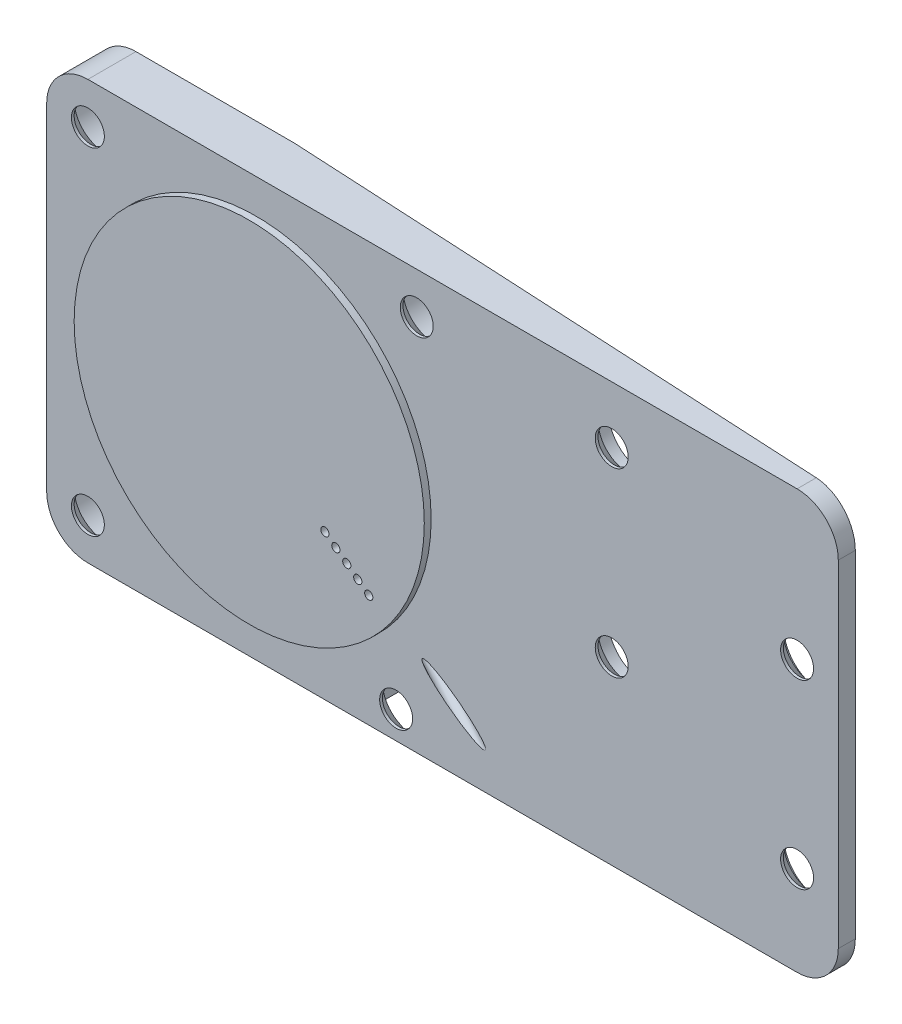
ISO-10303-21;
HEADER;
FILE_DESCRIPTION(('STEP AP214'),'2;1');
FILE_NAME('part.step','',(''),(''),'','','');
FILE_SCHEMA(('AUTOMOTIVE_DESIGN { 1 0 10303 214 1 1 1 1 }'));
ENDSEC;
DATA;
#1=APPLICATION_CONTEXT('core data for automotive mechanical design processes');
#2=APPLICATION_PROTOCOL_DEFINITION('international standard','automotive_design',2000,#1);
#3=PRODUCT_CONTEXT('',#1,'mechanical');
#4=PRODUCT('Part','Part','',(#3));
#5=PRODUCT_RELATED_PRODUCT_CATEGORY('part','',(#4));
#6=PRODUCT_DEFINITION_FORMATION('','',#4);
#7=PRODUCT_DEFINITION_CONTEXT('part definition',#1,'design');
#8=PRODUCT_DEFINITION('design','',#6,#7);
#9=PRODUCT_DEFINITION_SHAPE('','',#8);
#10=(LENGTH_UNIT() NAMED_UNIT(*) SI_UNIT(.MILLI.,.METRE.));
#11=(NAMED_UNIT(*) PLANE_ANGLE_UNIT() SI_UNIT($,.RADIAN.));
#12=(NAMED_UNIT(*) SI_UNIT($,.STERADIAN.) SOLID_ANGLE_UNIT());
#13=UNCERTAINTY_MEASURE_WITH_UNIT(LENGTH_MEASURE(1.E-05),#10,'distance_accuracy_value','');
#14=(GEOMETRIC_REPRESENTATION_CONTEXT(3) GLOBAL_UNCERTAINTY_ASSIGNED_CONTEXT((#13)) GLOBAL_UNIT_ASSIGNED_CONTEXT((#10,
#11,#12)) REPRESENTATION_CONTEXT('',''));
#15=CARTESIAN_POINT('',(0.,0.,0.));
#16=DIRECTION('',(0.,0.,1.));
#17=DIRECTION('',(1.,0.,0.));
#18=AXIS2_PLACEMENT_3D('',#15,#16,#17);
#19=CARTESIAN_POINT('',(19.5809830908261,-59.7,-6.));
#20=DIRECTION('',(0.0523359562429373,0.,-0.998629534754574));
#21=DIRECTION('',(-0.998629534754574,0.,-0.0523359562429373));
#22=AXIS2_PLACEMENT_3D('',#19,#20,#21);
#23=PLANE('',#22);
#24=CARTESIAN_POINT('',(46.2,-65.9,-4.60495643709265));
#25=DIRECTION('',(0.0523359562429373,0.,-0.998629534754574));
#26=DIRECTION('',(-0.998629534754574,0.,-0.0523359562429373));
#27=AXIS2_PLACEMENT_3D('',#24,#25,#26);
#28=ELLIPSE('',#27,2.5034308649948,2.5);
#29=CARTESIAN_POINT('',(43.7,-65.9,-4.73597588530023));
#30=VERTEX_POINT('',#29);
#31=EDGE_CURVE('E217',#30,#30,#28,.T.);
#32=ORIENTED_EDGE('',*,*,#31,.F.);
#33=EDGE_LOOP('',(#32));
#34=FACE_BOUND('',#33,.T.);
#35=CARTESIAN_POINT('',(31.9991301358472,-64.75,-5.34919249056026));
#36=DIRECTION('',(0.0523359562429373,0.,-0.998629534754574));
#37=DIRECTION('',(-0.998629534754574,0.,-0.0523359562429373));
#38=AXIS2_PLACEMENT_3D('',#35,#36,#37);
#39=ELLIPSE('',#38,2.5034308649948,2.5);
#40=CARTESIAN_POINT('',(29.4991301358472,-64.75,-5.48021193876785));
#41=VERTEX_POINT('',#40);
#42=EDGE_CURVE('E230',#41,#41,#39,.T.);
#43=ORIENTED_EDGE('',*,*,#42,.F.);
#44=EDGE_LOOP('',(#43));
#45=FACE_BOUND('',#44,.T.);
#46=CARTESIAN_POINT('',(46.2,-79.1,-4.60495643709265));
#47=DIRECTION('',(0.0523359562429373,0.,-0.998629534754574));
#48=DIRECTION('',(-0.998629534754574,0.,-0.0523359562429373));
#49=AXIS2_PLACEMENT_3D('',#46,#47,#48);
#50=ELLIPSE('',#49,2.5034308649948,2.5);
#51=CARTESIAN_POINT('',(43.7,-79.1,-4.73597588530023));
#52=VERTEX_POINT('',#51);
#53=EDGE_CURVE('E243',#52,#52,#50,.T.);
#54=ORIENTED_EDGE('',*,*,#53,.F.);
#55=EDGE_LOOP('',(#54));
#56=FACE_BOUND('',#55,.T.);
#57=CARTESIAN_POINT('',(59.7,-72.5,-3.89745141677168));
#58=DIRECTION('',(0.0523359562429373,0.,-0.998629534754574));
#59=DIRECTION('',(-0.998629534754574,0.,-0.0523359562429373));
#60=AXIS2_PLACEMENT_3D('',#57,#58,#59);
#61=ELLIPSE('',#60,2.5034308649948,2.5);
#62=CARTESIAN_POINT('',(57.2,-72.5,-4.02847086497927));
#63=VERTEX_POINT('',#62);
#64=EDGE_CURVE('E256',#63,#63,#61,.T.);
#65=ORIENTED_EDGE('',*,*,#64,.F.);
#66=EDGE_LOOP('',(#65));
#67=FACE_BOUND('',#66,.T.);
#68=CARTESIAN_POINT('',(59.7,-85.7,-3.89745141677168));
#69=DIRECTION('',(0.0523359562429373,0.,-0.998629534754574));
#70=DIRECTION('',(-0.998629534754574,0.,-0.0523359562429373));
#71=AXIS2_PLACEMENT_3D('',#68,#69,#70);
#72=ELLIPSE('',#71,2.5034308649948,2.5);
#73=CARTESIAN_POINT('',(57.2,-85.7,-4.02847086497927));
#74=VERTEX_POINT('',#73);
#75=EDGE_CURVE('E269',#74,#74,#72,.T.);
#76=ORIENTED_EDGE('',*,*,#75,.F.);
#77=EDGE_LOOP('',(#76));
#78=FACE_BOUND('',#77,.T.);
#79=DIRECTION('',(0.998629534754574,0.,0.0523359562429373));
#80=VECTOR('',#79,1.);
#81=CARTESIAN_POINT('',(8.04178284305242,-92.25,-6.60474385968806));
#82=LINE('',#81,#80);
#83=CARTESIAN_POINT('',(33.5,-92.25,-5.27053523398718));
#84=VERTEX_POINT('',#83);
#85=CARTESIAN_POINT('',(59.7,-92.25,-3.89745141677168));
#86=VERTEX_POINT('',#85);
#87=EDGE_CURVE('E457',#84,#86,#82,.T.);
#88=ORIENTED_EDGE('',*,*,#87,.F.);
#89=DIRECTION('',(0.706621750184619,-0.706621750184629,0.0370324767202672));
#90=VECTOR('',#89,1.);
#91=CARTESIAN_POINT('',(10.2782668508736,-69.0282668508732,-6.48753469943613));
#92=LINE('',#91,#90);
#93=CARTESIAN_POINT('',(33.,-91.75,-5.2967391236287));
#94=VERTEX_POINT('',#93);
#95=EDGE_CURVE('E428',#84,#94,#92,.F.);
#96=ORIENTED_EDGE('',*,*,#95,.T.);
#97=DIRECTION('',(0.,1.,0.));
#98=VECTOR('',#97,1.);
#99=CARTESIAN_POINT('',(33.,-59.7,-5.2967391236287));
#100=LINE('',#99,#98);
#101=CARTESIAN_POINT('',(33.,-90.25,-5.2967391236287));
#102=VERTEX_POINT('',#101);
#103=EDGE_CURVE('E645',#94,#102,#100,.T.);
#104=ORIENTED_EDGE('',*,*,#103,.T.);
#105=CARTESIAN_POINT('',(30.5,-90.25,-5.42775857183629));
#106=DIRECTION('',(0.0523359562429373,0.,-0.998629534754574));
#107=DIRECTION('',(-0.998629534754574,0.,-0.0523359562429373));
#108=AXIS2_PLACEMENT_3D('',#105,#106,#107);
#109=ELLIPSE('',#108,2.5034308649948,2.5);
#110=CARTESIAN_POINT('',(28.,-90.25,-5.55877802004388));
#111=VERTEX_POINT('',#110);
#112=EDGE_CURVE('E183',#111,#102,#109,.T.);
#113=ORIENTED_EDGE('',*,*,#112,.F.);
#114=DIRECTION('',(0.,-1.,0.));
#115=VECTOR('',#114,1.);
#116=CARTESIAN_POINT('',(28.,-59.7,-5.55877802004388));
#117=LINE('',#116,#115);
#118=CARTESIAN_POINT('',(28.,-91.75,-5.55877802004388));
#119=VERTEX_POINT('',#118);
#120=EDGE_CURVE('E452',#111,#119,#117,.T.);
#121=ORIENTED_EDGE('',*,*,#120,.T.);
#122=DIRECTION('',(0.706621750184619,0.706621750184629,0.0370324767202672));
#123=VECTOR('',#122,1.);
#124=CARTESIAN_POINT('',(39.7877418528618,-79.962258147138,-4.9410086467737));
#125=LINE('',#124,#123);
#126=CARTESIAN_POINT('',(27.5,-92.25,-5.58498190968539));
#127=VERTEX_POINT('',#126);
#128=EDGE_CURVE('E432',#119,#127,#125,.F.);
#129=ORIENTED_EDGE('',*,*,#128,.T.);
#130=CARTESIAN_POINT('',(19.5809830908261,-92.25,-6.));
#131=VERTEX_POINT('',#130);
#132=EDGE_CURVE('E450',#131,#127,#82,.T.);
#133=ORIENTED_EDGE('',*,*,#132,.F.);
#134=DIRECTION('',(0.,-1.,0.));
#135=VECTOR('',#134,1.);
#136=CARTESIAN_POINT('',(19.5809830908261,-59.7,-6.));
#137=LINE('',#136,#135);
#138=CARTESIAN_POINT('',(19.5809830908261,-61.75,-6.));
#139=VERTEX_POINT('',#138);
#140=EDGE_CURVE('E588',#139,#131,#137,.T.);
#141=ORIENTED_EDGE('',*,*,#140,.F.);
#142=DIRECTION('',(-0.998629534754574,0.,-0.0523359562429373));
#143=VECTOR('',#142,1.);
#144=CARTESIAN_POINT('',(8.04178284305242,-61.75,-6.60474385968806));
#145=LINE('',#144,#143);
#146=CARTESIAN_POINT('',(59.7,-61.75,-3.89745141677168));
#147=VERTEX_POINT('',#146);
#148=EDGE_CURVE('E476',#147,#139,#145,.T.);
#149=ORIENTED_EDGE('',*,*,#148,.F.);
#150=CARTESIAN_POINT('',(59.7,-64.75,-3.89745141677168));
#151=DIRECTION('',(0.0523359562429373,0.,-0.998629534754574));
#152=DIRECTION('',(0.998629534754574,0.,0.0523359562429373));
#153=AXIS2_PLACEMENT_3D('',#150,#151,#152);
#154=ELLIPSE('',#153,3.00411703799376,3.);
#155=CARTESIAN_POINT('',(62.7,-64.75,-3.74022807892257));
#156=VERTEX_POINT('',#155);
#157=EDGE_CURVE('E477',#156,#147,#154,.F.);
#158=ORIENTED_EDGE('',*,*,#157,.F.);
#159=DIRECTION('',(0.,1.,0.));
#160=VECTOR('',#159,1.);
#161=CARTESIAN_POINT('',(62.7,-89.25,-3.74022807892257));
#162=LINE('',#161,#160);
#163=CARTESIAN_POINT('',(62.7,-89.25,-3.74022807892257));
#164=VERTEX_POINT('',#163);
#165=EDGE_CURVE('E480',#164,#156,#162,.T.);
#166=ORIENTED_EDGE('',*,*,#165,.F.);
#167=CARTESIAN_POINT('',(59.7,-89.25,-3.89745141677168));
#168=DIRECTION('',(0.0523359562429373,0.,-0.998629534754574));
#169=DIRECTION('',(0.998629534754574,0.,0.0523359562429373));
#170=AXIS2_PLACEMENT_3D('',#167,#168,#169);
#171=ELLIPSE('',#170,3.00411703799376,3.);
#172=EDGE_CURVE('E459',#86,#164,#171,.F.);
#173=ORIENTED_EDGE('',*,*,#172,.F.);
#174=EDGE_LOOP('',(#88,#96,#104,#113,#121,#129,#133,#141,#149,#158,#166,#173));
#175=FACE_BOUND('',#174,.T.);
#176=ADVANCED_FACE('F47',(#34,#45,#56,#67,#78,#175),#23,.T.);
#177=CARTESIAN_POINT('',(8.05,-92.25,-6.76153655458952));
#178=DIRECTION('',(0.,-1.,0.));
#179=DIRECTION('',(0.,0.,-1.));
#180=AXIS2_PLACEMENT_3D('',#177,#178,#179);
#181=PLANE('',#180);
#182=DIRECTION('',(-1.,0.,0.));
#183=VECTOR('',#182,1.);
#184=CARTESIAN_POINT('',(8.05,-92.25,-3.69999999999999));
#185=LINE('',#184,#183);
#186=CARTESIAN_POINT('',(33.5,-92.25,-3.69999999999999));
#187=VERTEX_POINT('',#186);
#188=CARTESIAN_POINT('',(31.4165151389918,-92.25,-3.69999999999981));
#189=VERTEX_POINT('',#188);
#190=EDGE_CURVE('E438',#187,#189,#185,.T.);
#191=ORIENTED_EDGE('',*,*,#190,.F.);
#192=DIRECTION('',(0.,0.,-1.));
#193=VECTOR('',#192,1.);
#194=CARTESIAN_POINT('',(33.5,-92.25,-6.76153655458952));
#195=LINE('',#194,#193);
#196=EDGE_CURVE('E429',#187,#84,#195,.T.);
#197=ORIENTED_EDGE('',*,*,#196,.T.);
#198=ORIENTED_EDGE('',*,*,#87,.T.);
#199=DIRECTION('',(0.,0.,1.));
#200=VECTOR('',#199,1.);
#201=CARTESIAN_POINT('',(59.7,-92.25,-6.76153655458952));
#202=LINE('',#201,#200);
#203=CARTESIAN_POINT('',(59.7,-92.25,-2.5));
#204=VERTEX_POINT('',#203);
#205=EDGE_CURVE('E456',#86,#204,#202,.T.);
#206=ORIENTED_EDGE('',*,*,#205,.T.);
#207=DIRECTION('',(1.,0.,0.));
#208=VECTOR('',#207,1.);
#209=CARTESIAN_POINT('',(8.05,-92.25,-2.5));
#210=LINE('',#209,#208);
#211=CARTESIAN_POINT('',(8.05,-92.25,-2.5));
#212=VERTEX_POINT('',#211);
#213=EDGE_CURVE('E603',#212,#204,#210,.T.);
#214=ORIENTED_EDGE('',*,*,#213,.F.);
#215=DIRECTION('',(0.,0.,1.));
#216=VECTOR('',#215,1.);
#217=CARTESIAN_POINT('',(8.05,-92.25,-6.76153655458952));
#218=LINE('',#217,#216);
#219=CARTESIAN_POINT('',(8.05,-92.25,-6.00000000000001));
#220=VERTEX_POINT('',#219);
#221=EDGE_CURVE('E465',#220,#212,#218,.T.);
#222=ORIENTED_EDGE('',*,*,#221,.F.);
#223=DIRECTION('',(1.,0.,0.));
#224=VECTOR('',#223,1.);
#225=CARTESIAN_POINT('',(8.05,-92.25,-6.00000000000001));
#226=LINE('',#225,#224);
#227=EDGE_CURVE('E455',#220,#131,#226,.T.);
#228=ORIENTED_EDGE('',*,*,#227,.T.);
#229=ORIENTED_EDGE('',*,*,#132,.T.);
#230=DIRECTION('',(0.,0.,1.));
#231=VECTOR('',#230,1.);
#232=CARTESIAN_POINT('',(27.5,-92.25,-6.76153655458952));
#233=LINE('',#232,#231);
#234=CARTESIAN_POINT('',(27.5,-92.25,-3.69999999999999));
#235=VERTEX_POINT('',#234);
#236=EDGE_CURVE('E447',#127,#235,#233,.T.);
#237=ORIENTED_EDGE('',*,*,#236,.T.);
#238=CARTESIAN_POINT('',(29.5834848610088,-92.25,-3.69999999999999));
#239=VERTEX_POINT('',#238);
#240=EDGE_CURVE('E389',#239,#235,#185,.T.);
#241=ORIENTED_EDGE('',*,*,#240,.F.);
#242=CARTESIAN_POINT('',(22.8647629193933,-92.25,-9.39283505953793));
#243=CARTESIAN_POINT('',(23.0648315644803,-92.25,-9.19931388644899));
#244=CARTESIAN_POINT('',(23.2651278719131,-92.25,-9.00602691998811));
#245=CARTESIAN_POINT('',(23.6663559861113,-92.25,-8.62008488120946));
#246=CARTESIAN_POINT('',(23.8672878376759,-92.25,-8.42742985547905));
#247=CARTESIAN_POINT('',(24.2705879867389,-92.25,-8.04232286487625));
#248=CARTESIAN_POINT('',(24.4729588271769,-92.25,-7.8498735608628));
#249=CARTESIAN_POINT('',(24.8787358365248,-92.25,-7.46609238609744));
#250=CARTESIAN_POINT('',(25.0821419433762,-92.25,-7.27476044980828));
#251=CARTESIAN_POINT('',(25.5159709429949,-92.25,-6.86970756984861));
#252=CARTESIAN_POINT('',(25.7465825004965,-92.25,-6.65618845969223));
#253=CARTESIAN_POINT('',(26.2104569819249,-92.25,-6.23194255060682));
#254=CARTESIAN_POINT('',(26.4437204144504,-92.25,-6.0212163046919));
#255=CARTESIAN_POINT('',(26.7964358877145,-92.25,-5.70873721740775));
#256=CARTESIAN_POINT('',(26.9143691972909,-92.25,-5.60527172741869));
#257=CARTESIAN_POINT('',(27.1515297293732,-92.25,-5.39983649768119));
#258=CARTESIAN_POINT('',(27.2707569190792,-92.25,-5.29786672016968));
#259=CARTESIAN_POINT('',(27.5108463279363,-92.25,-5.09594543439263));
#260=CARTESIAN_POINT('',(27.6317080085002,-92.25,-4.99599328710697));
#261=CARTESIAN_POINT('',(27.8756267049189,-92.25,-4.7988114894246));
#262=CARTESIAN_POINT('',(27.9986834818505,-92.25,-4.70158154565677));
#263=CARTESIAN_POINT('',(28.1864866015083,-92.25,-4.55789139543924));
#264=CARTESIAN_POINT('',(28.2501305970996,-92.25,-4.50999082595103));
#265=CARTESIAN_POINT('',(28.3783258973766,-92.25,-4.41541149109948));
#266=CARTESIAN_POINT('',(28.4428772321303,-92.25,-4.36873276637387));
#267=CARTESIAN_POINT('',(28.5731304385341,-92.25,-4.27681369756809));
#268=CARTESIAN_POINT('',(28.6388337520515,-92.25,-4.23157539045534));
#269=CARTESIAN_POINT('',(28.7714932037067,-92.25,-4.14297134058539));
#270=CARTESIAN_POINT('',(28.8384492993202,-92.25,-4.09960553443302));
#271=CARTESIAN_POINT('',(28.9727819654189,-92.25,-4.01588519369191));
#272=CARTESIAN_POINT('',(29.0401357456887,-92.25,-3.97549427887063));
#273=CARTESIAN_POINT('',(29.1765214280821,-92.25,-3.89759481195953));
#274=CARTESIAN_POINT('',(29.245553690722,-92.25,-3.86008688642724));
#275=CARTESIAN_POINT('',(29.385358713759,-92.25,-3.7888458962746));
#276=CARTESIAN_POINT('',(29.4561271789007,-92.25,-3.75510447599));
#277=CARTESIAN_POINT('',(29.5997189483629,-92.25,-3.69233684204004));
#278=CARTESIAN_POINT('',(29.6725413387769,-92.25,-3.66330856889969));
#279=CARTESIAN_POINT('',(29.80858924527,-92.25,-3.61534108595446));
#280=CARTESIAN_POINT('',(29.8715054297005,-92.25,-3.59553195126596));
#281=CARTESIAN_POINT('',(29.9987256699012,-92.25,-3.56095427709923));
#282=CARTESIAN_POINT('',(30.0630296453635,-92.25,-3.54618544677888));
#283=CARTESIAN_POINT('',(30.1923283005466,-92.25,-3.52253567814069));
#284=CARTESIAN_POINT('',(30.2573164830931,-92.25,-3.51361979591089));
#285=CARTESIAN_POINT('',(30.3878542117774,-92.25,-3.50208734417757));
#286=CARTESIAN_POINT('',(30.4534037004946,-92.25,-3.49947013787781));
#287=CARTESIAN_POINT('',(30.5825852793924,-92.25,-3.50069134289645));
#288=CARTESIAN_POINT('',(30.6462191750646,-92.25,-3.50434930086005));
#289=CARTESIAN_POINT('',(30.7728673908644,-92.25,-3.51754497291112));
#290=CARTESIAN_POINT('',(30.8358816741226,-92.25,-3.52708303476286));
#291=CARTESIAN_POINT('',(30.9612196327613,-92.25,-3.55156506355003));
#292=CARTESIAN_POINT('',(31.0235370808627,-92.25,-3.56654044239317));
#293=CARTESIAN_POINT('',(31.1468433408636,-92.25,-3.60116760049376));
#294=CARTESIAN_POINT('',(31.2078320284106,-92.25,-3.62081981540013));
#295=CARTESIAN_POINT('',(31.4024312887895,-92.25,-3.69057532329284));
#296=CARTESIAN_POINT('',(31.5332548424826,-92.25,-3.74843806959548));
#297=CARTESIAN_POINT('',(31.7886662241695,-92.25,-3.87663676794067));
#298=CARTESIAN_POINT('',(31.9132407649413,-92.25,-3.94699796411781));
#299=CARTESIAN_POINT('',(32.0972115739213,-92.25,-4.05904539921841));
#300=CARTESIAN_POINT('',(32.1584518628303,-92.25,-4.09775930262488));
#301=CARTESIAN_POINT('',(32.2798329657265,-92.25,-4.17687836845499));
#302=CARTESIAN_POINT('',(32.3399737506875,-92.25,-4.21728357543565));
#303=CARTESIAN_POINT('',(32.4592448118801,-92.25,-4.29942392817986));
#304=CARTESIAN_POINT('',(32.5183760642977,-92.25,-4.34115766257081));
#305=CARTESIAN_POINT('',(32.6358165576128,-92.25,-4.42575800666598));
#306=CARTESIAN_POINT('',(32.6941258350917,-92.25,-4.46862456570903));
#307=CARTESIAN_POINT('',(32.9039945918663,-92.25,-4.62553140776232));
#308=CARTESIAN_POINT('',(33.0535049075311,-92.25,-4.74231210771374));
#309=CARTESIAN_POINT('',(33.3492211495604,-92.25,-4.97999767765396));
#310=CARTESIAN_POINT('',(33.4954263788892,-92.25,-5.10090340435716));
#311=CARTESIAN_POINT('',(33.7855350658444,-92.25,-5.34560427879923));
#312=CARTESIAN_POINT('',(33.9294371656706,-92.25,-5.46940103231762));
#313=CARTESIAN_POINT('',(34.2154893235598,-92.25,-5.71900385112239));
#314=CARTESIAN_POINT('',(34.3576393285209,-92.25,-5.84480997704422));
#315=CARTESIAN_POINT('',(34.6409640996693,-92.25,-6.09821282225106));
#316=CARTESIAN_POINT('',(34.7821355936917,-92.25,-6.22581319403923));
#317=CARTESIAN_POINT('',(35.0634524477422,-92.25,-6.48214373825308));
#318=CARTESIAN_POINT('',(35.2035977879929,-92.25,-6.61087393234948));
#319=CARTESIAN_POINT('',(35.6227337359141,-92.25,-6.9982663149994));
#320=CARTESIAN_POINT('',(35.9005271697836,-92.25,-7.25822307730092));
#321=CARTESIAN_POINT('',(36.4175721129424,-92.25,-7.74590936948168));
#322=CARTESIAN_POINT('',(36.6570776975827,-92.25,-7.97337053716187));
#323=CARTESIAN_POINT('',(37.1349864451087,-92.25,-8.42949874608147));
#324=CARTESIAN_POINT('',(37.3733894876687,-92.25,-8.65816591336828));
#325=CARTESIAN_POINT('',(37.8483417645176,-92.25,-9.11537935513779));
#326=CARTESIAN_POINT('',(38.0848945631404,-92.25,-9.34392193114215));
#327=CARTESIAN_POINT('',(38.5573311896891,-92.25,-9.80164174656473));
#328=CARTESIAN_POINT('',(38.7932150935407,-92.25,-10.0308189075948));
#329=CARTESIAN_POINT('',(39.0288703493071,-92.25,-10.2602299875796));
#330=B_SPLINE_CURVE_WITH_KNOTS('',3,(#242,#243,#244,#245,#246,#247,#248,#249,#250,#251,#252,
#253,#254,#255,#256,#257,#258,#259,#260,#261,#262,#263,#264,#265,#266,#267,#268,#269,#270,#271,
#272,#273,#274,#275,#276,#277,#278,#279,#280,#281,#282,#283,#284,#285,#286,#287,#288,#289,#290,
#291,#292,#293,#294,#295,#296,#297,#298,#299,#300,#301,#302,#303,#304,#305,#306,#307,#308,#309,
#310,#311,#312,#313,#314,#315,#316,#317,#318,#319,#320,#321,#322,#323,#324,#325,#326,#327,#328,
#329),.UNSPECIFIED.,.F.,.F.,(4,2,2,2,2,2,2,2,2,2,2,2,2,2,2,2,2,2,2,2,2,2,2,2,2,2,2,2,2,2,2,2,2,
2,2,2,2,2,2,2,2,2,2,4),(0.,0.835046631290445,1.67015349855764,2.50795488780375,3.34570663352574,
4.28853501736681,5.23154738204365,5.70219798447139,6.17283668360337,6.64332390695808,
7.11376022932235,7.35271591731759,7.59167954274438,7.83096730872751,8.07024696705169,
8.3057999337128,8.54140394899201,8.7764744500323,9.01144195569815,9.20915015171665,
9.40684693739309,9.60335241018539,9.79983801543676,9.99076758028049,10.1817084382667,
10.3737704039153,10.5658502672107,10.9937960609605,11.4226162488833,11.6399451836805,
11.85727984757,12.0743908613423,12.2914921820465,12.8604963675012,13.4296194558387,
13.9990665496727,14.5685308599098,15.1394004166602,15.7102809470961,16.8516264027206,
17.8425381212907,18.8335555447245,19.8203168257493,20.8069612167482),.UNSPECIFIED.);
#331=EDGE_CURVE('E381',#189,#239,#330,.F.);
#332=ORIENTED_EDGE('',*,*,#331,.F.);
#333=EDGE_LOOP('',(#191,#197,#198,#206,#214,#222,#228,#229,#237,#241,#332));
#334=FACE_BOUND('',#333,.T.);
#335=ADVANCED_FACE('F393',(#334),#181,.T.);
#336=CARTESIAN_POINT('',(30.5,-90.25,-5.99999999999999));
#337=DIRECTION('',(0.,0.,-1.));
#338=DIRECTION('',(-1.,0.,0.));
#339=AXIS2_PLACEMENT_3D('',#336,#337,#338);
#340=CYLINDRICAL_SURFACE('',#339,2.5);
#341=ORIENTED_EDGE('',*,*,#112,.T.);
#342=DIRECTION('',(0.,0.,-1.));
#343=VECTOR('',#342,1.);
#344=CARTESIAN_POINT('',(33.,-90.25,-5.99999999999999));
#345=LINE('',#344,#343);
#346=CARTESIAN_POINT('',(33.,-90.25,-3.69999999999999));
#347=VERTEX_POINT('',#346);
#348=EDGE_CURVE('E169',#102,#347,#345,.F.);
#349=ORIENTED_EDGE('',*,*,#348,.T.);
#350=CARTESIAN_POINT('',(30.5,-90.25,-3.69999999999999));
#351=DIRECTION('',(0.,0.,-1.));
#352=DIRECTION('',(-1.,0.,0.));
#353=AXIS2_PLACEMENT_3D('',#350,#351,#352);
#354=CIRCLE('',#353,2.5);
#355=CARTESIAN_POINT('',(28.,-90.25,-3.69999999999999));
#356=VERTEX_POINT('',#355);
#357=EDGE_CURVE('E181',#356,#347,#354,.T.);
#358=ORIENTED_EDGE('',*,*,#357,.F.);
#359=DIRECTION('',(0.,0.,-1.));
#360=VECTOR('',#359,1.);
#361=CARTESIAN_POINT('',(28.,-90.25,-5.99999999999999));
#362=LINE('',#361,#360);
#363=EDGE_CURVE('E184',#111,#356,#362,.F.);
#364=ORIENTED_EDGE('',*,*,#363,.F.);
#365=EDGE_LOOP('',(#341,#349,#358,#364));
#366=FACE_BOUND('',#365,.T.);
#367=ADVANCED_FACE('F179',(#366),#340,.F.);
#368=CARTESIAN_POINT('',(0.,-59.7,-6.00000000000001));
#369=DIRECTION('',(0.,0.,-1.));
#370=DIRECTION('',(-1.,0.,0.));
#371=AXIS2_PLACEMENT_3D('',#368,#369,#370);
#372=PLANE('',#371);
#373=CARTESIAN_POINT('',(8.05000000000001,-64.75,-6.00000000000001));
#374=DIRECTION('',(0.,0.,-1.));
#375=DIRECTION('',(-1.,0.,0.));
#376=AXIS2_PLACEMENT_3D('',#373,#374,#375);
#377=CIRCLE('',#376,2.5);
#378=CARTESIAN_POINT('',(5.55000000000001,-64.75,-6.00000000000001));
#379=VERTEX_POINT('',#378);
#380=EDGE_CURVE('E646',#379,#379,#377,.T.);
#381=ORIENTED_EDGE('',*,*,#380,.F.);
#382=EDGE_LOOP('',(#381));
#383=FACE_BOUND('',#382,.T.);
#384=CARTESIAN_POINT('',(8.05000000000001,-89.25,-6.00000000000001));
#385=DIRECTION('',(0.,0.,-1.));
#386=DIRECTION('',(-1.,0.,0.));
#387=AXIS2_PLACEMENT_3D('',#384,#385,#386);
#388=CIRCLE('',#387,2.5);
#389=CARTESIAN_POINT('',(5.55000000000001,-89.25,-6.00000000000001));
#390=VERTEX_POINT('',#389);
#391=EDGE_CURVE('E665',#390,#390,#388,.T.);
#392=ORIENTED_EDGE('',*,*,#391,.F.);
#393=EDGE_LOOP('',(#392));
#394=FACE_BOUND('',#393,.T.);
#395=DIRECTION('',(-1.,0.,0.));
#396=VECTOR('',#395,1.);
#397=CARTESIAN_POINT('',(8.05,-61.75,-6.00000000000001));
#398=LINE('',#397,#396);
#399=CARTESIAN_POINT('',(8.05,-61.75,-6.00000000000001));
#400=VERTEX_POINT('',#399);
#401=EDGE_CURVE('E473',#139,#400,#398,.T.);
#402=ORIENTED_EDGE('',*,*,#401,.F.);
#403=ORIENTED_EDGE('',*,*,#140,.T.);
#404=ORIENTED_EDGE('',*,*,#227,.F.);
#405=CARTESIAN_POINT('',(8.05,-89.25,-6.00000000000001));
#406=DIRECTION('',(0.,0.,-1.));
#407=DIRECTION('',(-1.,0.,0.));
#408=AXIS2_PLACEMENT_3D('',#405,#406,#407);
#409=CIRCLE('',#408,3.);
#410=CARTESIAN_POINT('',(5.05,-89.25,-6.00000000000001));
#411=VERTEX_POINT('',#410);
#412=EDGE_CURVE('E466',#411,#220,#409,.F.);
#413=ORIENTED_EDGE('',*,*,#412,.F.);
#414=DIRECTION('',(0.,-1.,0.));
#415=VECTOR('',#414,1.);
#416=CARTESIAN_POINT('',(5.05,-89.25,-6.00000000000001));
#417=LINE('',#416,#415);
#418=CARTESIAN_POINT('',(5.05,-64.75,-6.00000000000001));
#419=VERTEX_POINT('',#418);
#420=EDGE_CURVE('E485',#419,#411,#417,.T.);
#421=ORIENTED_EDGE('',*,*,#420,.F.);
#422=CARTESIAN_POINT('',(8.05,-64.75,-6.00000000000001));
#423=DIRECTION('',(0.,0.,-1.));
#424=DIRECTION('',(-1.,0.,0.));
#425=AXIS2_PLACEMENT_3D('',#422,#423,#424);
#426=CIRCLE('',#425,3.);
#427=EDGE_CURVE('E472',#400,#419,#426,.F.);
#428=ORIENTED_EDGE('',*,*,#427,.F.);
#429=EDGE_LOOP('',(#402,#403,#404,#413,#421,#428));
#430=FACE_BOUND('',#429,.T.);
#431=ADVANCED_FACE('F413',(#383,#394,#430),#372,.T.);
#432=CARTESIAN_POINT('',(8.05,-64.75,-2.5));
#433=DIRECTION('',(0.,0.,1.));
#434=DIRECTION('',(1.,0.,0.));
#435=AXIS2_PLACEMENT_3D('',#432,#433,#434);
#436=PLANE('',#435);
#437=CARTESIAN_POINT('',(8.05000000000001,-64.75,-2.5));
#438=DIRECTION('',(0.,0.,-1.));
#439=DIRECTION('',(-1.,0.,0.));
#440=AXIS2_PLACEMENT_3D('',#437,#438,#439);
#441=CIRCLE('',#440,1.20000000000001);
#442=CARTESIAN_POINT('',(6.85,-64.75,-2.5));
#443=VERTEX_POINT('',#442);
#444=EDGE_CURVE('E662',#443,#443,#441,.T.);
#445=ORIENTED_EDGE('',*,*,#444,.T.);
#446=EDGE_LOOP('',(#445));
#447=FACE_BOUND('',#446,.T.);
#448=CARTESIAN_POINT('',(8.05000000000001,-89.25,-2.5));
#449=DIRECTION('',(0.,0.,-1.));
#450=DIRECTION('',(-1.,0.,0.));
#451=AXIS2_PLACEMENT_3D('',#448,#449,#450);
#452=CIRCLE('',#451,1.20000000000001);
#453=CARTESIAN_POINT('',(6.85,-89.25,-2.5));
#454=VERTEX_POINT('',#453);
#455=EDGE_CURVE('E190',#454,#454,#452,.T.);
#456=ORIENTED_EDGE('',*,*,#455,.T.);
#457=EDGE_LOOP('',(#456));
#458=FACE_BOUND('',#457,.T.);
#459=CARTESIAN_POINT('',(30.5,-90.25,-2.49999999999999));
#460=DIRECTION('',(0.,0.,-1.));
#461=DIRECTION('',(-1.,0.,0.));
#462=AXIS2_PLACEMENT_3D('',#459,#460,#461);
#463=CIRCLE('',#462,1.20000000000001);
#464=CARTESIAN_POINT('',(29.3,-90.25,-2.49999999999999));
#465=VERTEX_POINT('',#464);
#466=EDGE_CURVE('E201',#465,#465,#463,.T.);
#467=ORIENTED_EDGE('',*,*,#466,.T.);
#468=EDGE_LOOP('',(#467));
#469=FACE_BOUND('',#468,.T.);
#470=CARTESIAN_POINT('',(46.2,-65.9,-2.49999999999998));
#471=DIRECTION('',(0.,0.,-1.));
#472=DIRECTION('',(-1.,0.,0.));
#473=AXIS2_PLACEMENT_3D('',#470,#471,#472);
#474=CIRCLE('',#473,1.20000000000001);
#475=CARTESIAN_POINT('',(45.,-65.9,-2.49999999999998));
#476=VERTEX_POINT('',#475);
#477=EDGE_CURVE('E214',#476,#476,#474,.T.);
#478=ORIENTED_EDGE('',*,*,#477,.T.);
#479=EDGE_LOOP('',(#478));
#480=FACE_BOUND('',#479,.T.);
#481=CARTESIAN_POINT('',(31.9991301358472,-64.75,-2.49999999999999));
#482=DIRECTION('',(0.,0.,-1.));
#483=DIRECTION('',(-1.,0.,0.));
#484=AXIS2_PLACEMENT_3D('',#481,#482,#483);
#485=CIRCLE('',#484,1.20000000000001);
#486=CARTESIAN_POINT('',(30.7991301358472,-64.75,-2.49999999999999));
#487=VERTEX_POINT('',#486);
#488=EDGE_CURVE('E227',#487,#487,#485,.T.);
#489=ORIENTED_EDGE('',*,*,#488,.T.);
#490=EDGE_LOOP('',(#489));
#491=FACE_BOUND('',#490,.T.);
#492=CARTESIAN_POINT('',(46.2,-79.1,-2.49999999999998));
#493=DIRECTION('',(0.,0.,-1.));
#494=DIRECTION('',(-1.,0.,0.));
#495=AXIS2_PLACEMENT_3D('',#492,#493,#494);
#496=CIRCLE('',#495,1.20000000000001);
#497=CARTESIAN_POINT('',(45.,-79.1,-2.49999999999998));
#498=VERTEX_POINT('',#497);
#499=EDGE_CURVE('E240',#498,#498,#496,.T.);
#500=ORIENTED_EDGE('',*,*,#499,.T.);
#501=EDGE_LOOP('',(#500));
#502=FACE_BOUND('',#501,.T.);
#503=CARTESIAN_POINT('',(59.7,-72.5,-2.49999999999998));
#504=DIRECTION('',(0.,0.,-1.));
#505=DIRECTION('',(-1.,0.,0.));
#506=AXIS2_PLACEMENT_3D('',#503,#504,#505);
#507=CIRCLE('',#506,1.20000000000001);
#508=CARTESIAN_POINT('',(58.5,-72.5,-2.49999999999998));
#509=VERTEX_POINT('',#508);
#510=EDGE_CURVE('E253',#509,#509,#507,.T.);
#511=ORIENTED_EDGE('',*,*,#510,.T.);
#512=EDGE_LOOP('',(#511));
#513=FACE_BOUND('',#512,.T.);
#514=CARTESIAN_POINT('',(59.7,-85.7,-2.49999999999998));
#515=DIRECTION('',(0.,0.,-1.));
#516=DIRECTION('',(-1.,0.,0.));
#517=AXIS2_PLACEMENT_3D('',#514,#515,#516);
#518=CIRCLE('',#517,1.20000000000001);
#519=CARTESIAN_POINT('',(58.5,-85.7,-2.49999999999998));
#520=VERTEX_POINT('',#519);
#521=EDGE_CURVE('E266',#520,#520,#518,.T.);
#522=ORIENTED_EDGE('',*,*,#521,.T.);
#523=EDGE_LOOP('',(#522));
#524=FACE_BOUND('',#523,.T.);
#525=CARTESIAN_POINT('',(34.6989072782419,-87.8503548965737,-2.5));
#526=DIRECTION('',(0.,0.,1.));
#527=DIRECTION('',(0.798635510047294,-0.601815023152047,0.));
#528=AXIS2_PLACEMENT_3D('',#525,#526,#527);
#529=ELLIPSE('',#528,2.87938524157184,0.500000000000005);
#530=CARTESIAN_POINT('',(36.9984865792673,-89.5832121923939,-2.5));
#531=VERTEX_POINT('',#530);
#532=EDGE_CURVE('E487',#531,#531,#529,.T.);
#533=ORIENTED_EDGE('',*,*,#532,.F.);
#534=EDGE_LOOP('',(#533));
#535=FACE_BOUND('',#534,.T.);
#536=CARTESIAN_POINT('',(20.3,-77.,-2.5));
#537=DIRECTION('',(0.,0.,1.));
#538=DIRECTION('',(1.,0.,0.));
#539=AXIS2_PLACEMENT_3D('',#536,#537,#538);
#540=CIRCLE('',#539,12.75);
#541=CARTESIAN_POINT('',(33.05,-77.,-2.5));
#542=VERTEX_POINT('',#541);
#543=EDGE_CURVE('E490',#542,#542,#540,.F.);
#544=ORIENTED_EDGE('',*,*,#543,.T.);
#545=EDGE_LOOP('',(#544));
#546=FACE_BOUND('',#545,.T.);
#547=CARTESIAN_POINT('',(8.05,-64.75,-2.5));
#548=DIRECTION('',(0.,0.,1.));
#549=DIRECTION('',(1.,0.,0.));
#550=AXIS2_PLACEMENT_3D('',#547,#548,#549);
#551=CIRCLE('',#550,3.);
#552=CARTESIAN_POINT('',(8.05,-61.75,-2.5));
#553=VERTEX_POINT('',#552);
#554=CARTESIAN_POINT('',(5.05,-64.75,-2.5));
#555=VERTEX_POINT('',#554);
#556=EDGE_CURVE('E612',#553,#555,#551,.T.);
#557=ORIENTED_EDGE('',*,*,#556,.T.);
#558=DIRECTION('',(0.,-1.,0.));
#559=VECTOR('',#558,1.);
#560=CARTESIAN_POINT('',(5.05,-89.25,-2.5));
#561=LINE('',#560,#559);
#562=CARTESIAN_POINT('',(5.05,-89.25,-2.5));
#563=VERTEX_POINT('',#562);
#564=EDGE_CURVE('E609',#555,#563,#561,.T.);
#565=ORIENTED_EDGE('',*,*,#564,.T.);
#566=CARTESIAN_POINT('',(8.05,-89.25,-2.5));
#567=DIRECTION('',(0.,0.,1.));
#568=DIRECTION('',(1.,0.,0.));
#569=AXIS2_PLACEMENT_3D('',#566,#567,#568);
#570=CIRCLE('',#569,3.);
#571=EDGE_CURVE('E606',#563,#212,#570,.T.);
#572=ORIENTED_EDGE('',*,*,#571,.T.);
#573=ORIENTED_EDGE('',*,*,#213,.T.);
#574=CARTESIAN_POINT('',(59.7,-89.25,-2.5));
#575=DIRECTION('',(0.,0.,1.));
#576=DIRECTION('',(1.,0.,0.));
#577=AXIS2_PLACEMENT_3D('',#574,#575,#576);
#578=CIRCLE('',#577,3.);
#579=CARTESIAN_POINT('',(62.7,-89.25,-2.5));
#580=VERTEX_POINT('',#579);
#581=EDGE_CURVE('E600',#204,#580,#578,.T.);
#582=ORIENTED_EDGE('',*,*,#581,.T.);
#583=DIRECTION('',(0.,1.,0.));
#584=VECTOR('',#583,1.);
#585=CARTESIAN_POINT('',(62.7,-89.25,-2.5));
#586=LINE('',#585,#584);
#587=CARTESIAN_POINT('',(62.7,-64.75,-2.5));
#588=VERTEX_POINT('',#587);
#589=EDGE_CURVE('E597',#580,#588,#586,.T.);
#590=ORIENTED_EDGE('',*,*,#589,.T.);
#591=CARTESIAN_POINT('',(59.7,-64.75,-2.5));
#592=DIRECTION('',(0.,0.,1.));
#593=DIRECTION('',(1.,0.,0.));
#594=AXIS2_PLACEMENT_3D('',#591,#592,#593);
#595=CIRCLE('',#594,3.);
#596=CARTESIAN_POINT('',(59.7,-61.75,-2.5));
#597=VERTEX_POINT('',#596);
#598=EDGE_CURVE('E594',#588,#597,#595,.T.);
#599=ORIENTED_EDGE('',*,*,#598,.T.);
#600=DIRECTION('',(-1.,0.,0.));
#601=VECTOR('',#600,1.);
#602=CARTESIAN_POINT('',(8.05,-61.75,-2.5));
#603=LINE('',#602,#601);
#604=EDGE_CURVE('E591',#597,#553,#603,.T.);
#605=ORIENTED_EDGE('',*,*,#604,.T.);
#606=EDGE_LOOP('',(#557,#565,#572,#573,#582,#590,#599,#605));
#607=FACE_BOUND('',#606,.T.);
#608=ADVANCED_FACE('F408',(#447,#458,#469,#480,#491,#502,#513,#524,#535,#546,#607),#436,.T.);
#609=CARTESIAN_POINT('',(5.05,-89.25,-6.76153655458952));
#610=DIRECTION('',(-1.,0.,0.));
#611=DIRECTION('',(0.,0.,1.));
#612=AXIS2_PLACEMENT_3D('',#609,#610,#611);
#613=PLANE('',#612);
#614=DIRECTION('',(0.,0.,1.));
#615=VECTOR('',#614,1.);
#616=CARTESIAN_POINT('',(5.05,-64.75,-6.76153655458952));
#617=LINE('',#616,#615);
#618=EDGE_CURVE('E390',#419,#555,#617,.T.);
#619=ORIENTED_EDGE('',*,*,#618,.F.);
#620=ORIENTED_EDGE('',*,*,#420,.T.);
#621=DIRECTION('',(0.,0.,1.));
#622=VECTOR('',#621,1.);
#623=CARTESIAN_POINT('',(5.05,-89.25,-6.76153655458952));
#624=LINE('',#623,#622);
#625=EDGE_CURVE('E469',#411,#563,#624,.T.);
#626=ORIENTED_EDGE('',*,*,#625,.T.);
#627=ORIENTED_EDGE('',*,*,#564,.F.);
#628=EDGE_LOOP('',(#619,#620,#626,#627));
#629=FACE_BOUND('',#628,.T.);
#630=ADVANCED_FACE('F404',(#629),#613,.T.);
#631=CARTESIAN_POINT('',(8.05,-89.25,-6.76153655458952));
#632=DIRECTION('',(0.,0.,1.));
#633=DIRECTION('',(1.,0.,0.));
#634=AXIS2_PLACEMENT_3D('',#631,#632,#633);
#635=CYLINDRICAL_SURFACE('',#634,3.);
#636=ORIENTED_EDGE('',*,*,#625,.F.);
#637=ORIENTED_EDGE('',*,*,#412,.T.);
#638=ORIENTED_EDGE('',*,*,#221,.T.);
#639=ORIENTED_EDGE('',*,*,#571,.F.);
#640=EDGE_LOOP('',(#636,#637,#638,#639));
#641=FACE_BOUND('',#640,.T.);
#642=ADVANCED_FACE('F401',(#641),#635,.T.);
#643=CARTESIAN_POINT('',(59.7,-89.25,-6.76153655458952));
#644=DIRECTION('',(0.,0.,1.));
#645=DIRECTION('',(1.,0.,0.));
#646=AXIS2_PLACEMENT_3D('',#643,#644,#645);
#647=CYLINDRICAL_SURFACE('',#646,3.);
#648=ORIENTED_EDGE('',*,*,#205,.F.);
#649=ORIENTED_EDGE('',*,*,#172,.T.);
#650=DIRECTION('',(0.,0.,1.));
#651=VECTOR('',#650,1.);
#652=CARTESIAN_POINT('',(62.7,-89.25,-6.76153655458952));
#653=LINE('',#652,#651);
#654=EDGE_CURVE('E481',#164,#580,#653,.T.);
#655=ORIENTED_EDGE('',*,*,#654,.T.);
#656=ORIENTED_EDGE('',*,*,#581,.F.);
#657=EDGE_LOOP('',(#648,#649,#655,#656));
#658=FACE_BOUND('',#657,.T.);
#659=ADVANCED_FACE('F399',(#658),#647,.T.);
#660=CARTESIAN_POINT('',(62.7,-89.25,-6.76153655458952));
#661=DIRECTION('',(1.,0.,0.));
#662=DIRECTION('',(0.,0.,-1.));
#663=AXIS2_PLACEMENT_3D('',#660,#661,#662);
#664=PLANE('',#663);
#665=ORIENTED_EDGE('',*,*,#654,.F.);
#666=ORIENTED_EDGE('',*,*,#165,.T.);
#667=DIRECTION('',(0.,0.,1.));
#668=VECTOR('',#667,1.);
#669=CARTESIAN_POINT('',(62.7,-64.75,-6.76153655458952));
#670=LINE('',#669,#668);
#671=EDGE_CURVE('E478',#156,#588,#670,.T.);
#672=ORIENTED_EDGE('',*,*,#671,.T.);
#673=ORIENTED_EDGE('',*,*,#589,.F.);
#674=EDGE_LOOP('',(#665,#666,#672,#673));
#675=FACE_BOUND('',#674,.T.);
#676=ADVANCED_FACE('F628',(#675),#664,.T.);
#677=CARTESIAN_POINT('',(59.7,-64.75,-6.76153655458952));
#678=DIRECTION('',(0.,0.,1.));
#679=DIRECTION('',(1.,0.,0.));
#680=AXIS2_PLACEMENT_3D('',#677,#678,#679);
#681=CYLINDRICAL_SURFACE('',#680,3.);
#682=ORIENTED_EDGE('',*,*,#671,.F.);
#683=ORIENTED_EDGE('',*,*,#157,.T.);
#684=DIRECTION('',(0.,0.,1.));
#685=VECTOR('',#684,1.);
#686=CARTESIAN_POINT('',(59.7,-61.75,-6.76153655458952));
#687=LINE('',#686,#685);
#688=EDGE_CURVE('E474',#147,#597,#687,.T.);
#689=ORIENTED_EDGE('',*,*,#688,.T.);
#690=ORIENTED_EDGE('',*,*,#598,.F.);
#691=EDGE_LOOP('',(#682,#683,#689,#690));
#692=FACE_BOUND('',#691,.T.);
#693=ADVANCED_FACE('F637',(#692),#681,.T.);
#694=CARTESIAN_POINT('',(8.05,-61.75,-6.76153655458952));
#695=DIRECTION('',(0.,1.,0.));
#696=DIRECTION('',(0.,0.,1.));
#697=AXIS2_PLACEMENT_3D('',#694,#695,#696);
#698=PLANE('',#697);
#699=ORIENTED_EDGE('',*,*,#688,.F.);
#700=ORIENTED_EDGE('',*,*,#148,.T.);
#701=ORIENTED_EDGE('',*,*,#401,.T.);
#702=DIRECTION('',(0.,0.,1.));
#703=VECTOR('',#702,1.);
#704=CARTESIAN_POINT('',(8.05,-61.75,-6.76153655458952));
#705=LINE('',#704,#703);
#706=EDGE_CURVE('E470',#400,#553,#705,.T.);
#707=ORIENTED_EDGE('',*,*,#706,.T.);
#708=ORIENTED_EDGE('',*,*,#604,.F.);
#709=EDGE_LOOP('',(#699,#700,#701,#707,#708));
#710=FACE_BOUND('',#709,.T.);
#711=ADVANCED_FACE('F700',(#710),#698,.T.);
#712=CARTESIAN_POINT('',(8.05,-64.75,-6.76153655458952));
#713=DIRECTION('',(0.,0.,1.));
#714=DIRECTION('',(1.,0.,0.));
#715=AXIS2_PLACEMENT_3D('',#712,#713,#714);
#716=CYLINDRICAL_SURFACE('',#715,3.);
#717=ORIENTED_EDGE('',*,*,#706,.F.);
#718=ORIENTED_EDGE('',*,*,#427,.T.);
#719=ORIENTED_EDGE('',*,*,#618,.T.);
#720=ORIENTED_EDGE('',*,*,#556,.F.);
#721=EDGE_LOOP('',(#717,#718,#719,#720));
#722=FACE_BOUND('',#721,.T.);
#723=ADVANCED_FACE('F704',(#722),#716,.T.);
#724=CARTESIAN_POINT('',(20.3,-77.,-6.00200000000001));
#725=DIRECTION('',(0.,0.,1.));
#726=DIRECTION('',(1.,0.,0.));
#727=AXIS2_PLACEMENT_3D('',#724,#725,#726);
#728=CYLINDRICAL_SURFACE('',#727,12.75);
#729=CARTESIAN_POINT('',(20.3,-77.,-2.));
#730=DIRECTION('',(0.,0.,1.));
#731=DIRECTION('',(1.,0.,0.));
#732=AXIS2_PLACEMENT_3D('',#729,#730,#731);
#733=CIRCLE('',#732,12.75);
#734=CARTESIAN_POINT('',(33.05,-77.,-2.));
#735=VERTEX_POINT('',#734);
#736=EDGE_CURVE('E585',#735,#735,#733,.T.);
#737=CARTESIAN_POINT('',(33.05,-77.,-2.5));
#738=CARTESIAN_POINT('',(33.05,-77.,-2.49479166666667));
#739=CARTESIAN_POINT('',(33.05,-77.,-2.48958333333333));
#740=CARTESIAN_POINT('',(33.05,-77.,-2.47916666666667));
#741=CARTESIAN_POINT('',(33.05,-77.,-2.47395833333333));
#742=CARTESIAN_POINT('',(33.05,-77.,-2.46354166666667));
#743=CARTESIAN_POINT('',(33.05,-77.,-2.45833333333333));
#744=CARTESIAN_POINT('',(33.05,-77.,-2.44791666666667));
#745=CARTESIAN_POINT('',(33.05,-77.,-2.44270833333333));
#746=CARTESIAN_POINT('',(33.05,-77.,-2.43229166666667));
#747=CARTESIAN_POINT('',(33.05,-77.,-2.42708333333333));
#748=CARTESIAN_POINT('',(33.05,-77.,-2.41666666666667));
#749=CARTESIAN_POINT('',(33.05,-77.,-2.41145833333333));
#750=CARTESIAN_POINT('',(33.05,-77.,-2.40104166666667));
#751=CARTESIAN_POINT('',(33.05,-77.,-2.39583333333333));
#752=CARTESIAN_POINT('',(33.05,-77.,-2.38541666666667));
#753=CARTESIAN_POINT('',(33.05,-77.,-2.38020833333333));
#754=CARTESIAN_POINT('',(33.05,-77.,-2.36979166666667));
#755=CARTESIAN_POINT('',(33.05,-77.,-2.36458333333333));
#756=CARTESIAN_POINT('',(33.05,-77.,-2.35416666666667));
#757=CARTESIAN_POINT('',(33.05,-77.,-2.34895833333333));
#758=CARTESIAN_POINT('',(33.05,-77.,-2.33854166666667));
#759=CARTESIAN_POINT('',(33.05,-77.,-2.33333333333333));
#760=CARTESIAN_POINT('',(33.05,-77.,-2.32291666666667));
#761=CARTESIAN_POINT('',(33.05,-77.,-2.31770833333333));
#762=CARTESIAN_POINT('',(33.05,-77.,-2.30729166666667));
#763=CARTESIAN_POINT('',(33.05,-77.,-2.30208333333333));
#764=CARTESIAN_POINT('',(33.05,-77.,-2.29166666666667));
#765=CARTESIAN_POINT('',(33.05,-77.,-2.28645833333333));
#766=CARTESIAN_POINT('',(33.05,-77.,-2.27604166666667));
#767=CARTESIAN_POINT('',(33.05,-77.,-2.27083333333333));
#768=CARTESIAN_POINT('',(33.05,-77.,-2.26041666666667));
#769=CARTESIAN_POINT('',(33.05,-77.,-2.25520833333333));
#770=CARTESIAN_POINT('',(33.05,-77.,-2.24479166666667));
#771=CARTESIAN_POINT('',(33.05,-77.,-2.23958333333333));
#772=CARTESIAN_POINT('',(33.05,-77.,-2.22916666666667));
#773=CARTESIAN_POINT('',(33.05,-77.,-2.22395833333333));
#774=CARTESIAN_POINT('',(33.05,-77.,-2.21354166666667));
#775=CARTESIAN_POINT('',(33.05,-77.,-2.20833333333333));
#776=CARTESIAN_POINT('',(33.05,-77.,-2.19791666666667));
#777=CARTESIAN_POINT('',(33.05,-77.,-2.19270833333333));
#778=CARTESIAN_POINT('',(33.05,-77.,-2.18229166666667));
#779=CARTESIAN_POINT('',(33.05,-77.,-2.17708333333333));
#780=CARTESIAN_POINT('',(33.05,-77.,-2.16666666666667));
#781=CARTESIAN_POINT('',(33.05,-77.,-2.16145833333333));
#782=CARTESIAN_POINT('',(33.05,-77.,-2.15104166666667));
#783=CARTESIAN_POINT('',(33.05,-77.,-2.14583333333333));
#784=CARTESIAN_POINT('',(33.05,-77.,-2.13541666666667));
#785=CARTESIAN_POINT('',(33.05,-77.,-2.13020833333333));
#786=CARTESIAN_POINT('',(33.05,-77.,-2.11979166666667));
#787=CARTESIAN_POINT('',(33.05,-77.,-2.11458333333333));
#788=CARTESIAN_POINT('',(33.05,-77.,-2.10416666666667));
#789=CARTESIAN_POINT('',(33.05,-77.,-2.09895833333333));
#790=CARTESIAN_POINT('',(33.05,-77.,-2.08854166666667));
#791=CARTESIAN_POINT('',(33.05,-77.,-2.08333333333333));
#792=CARTESIAN_POINT('',(33.05,-77.,-2.07291666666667));
#793=CARTESIAN_POINT('',(33.05,-77.,-2.06770833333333));
#794=CARTESIAN_POINT('',(33.05,-77.,-2.05729166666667));
#795=CARTESIAN_POINT('',(33.05,-77.,-2.05208333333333));
#796=CARTESIAN_POINT('',(33.05,-77.,-2.04166666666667));
#797=CARTESIAN_POINT('',(33.05,-77.,-2.03645833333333));
#798=CARTESIAN_POINT('',(33.05,-77.,-2.02604166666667));
#799=CARTESIAN_POINT('',(33.05,-77.,-2.02083333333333));
#800=CARTESIAN_POINT('',(33.05,-77.,-2.01041666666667));
#801=CARTESIAN_POINT('',(33.05,-77.,-2.00520833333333));
#802=CARTESIAN_POINT('',(33.05,-77.,-2.));
#803=B_SPLINE_CURVE_WITH_KNOTS('',3,(#737,#738,#739,#740,#741,#742,#743,#744,#745,#746,#747,
#748,#749,#750,#751,#752,#753,#754,#755,#756,#757,#758,#759,#760,#761,#762,#763,#764,#765,#766,
#767,#768,#769,#770,#771,#772,#773,#774,#775,#776,#777,#778,#779,#780,#781,#782,#783,#784,#785,
#786,#787,#788,#789,#790,#791,#792,#793,#794,#795,#796,#797,#798,#799,#800,#801,#802),
.UNSPECIFIED.,.F.,.F.,(4,2,2,2,2,2,2,2,2,2,2,2,2,2,2,2,2,2,2,2,2,2,2,2,2,2,2,2,2,2,2,2,4),(0.,
0.015625,0.03125,0.046875,0.0625000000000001,0.0781250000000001,0.0937500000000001,0.109375,
0.125,0.140625,0.15625,0.171875,0.1875,0.203125,0.21875,0.234375,0.25,0.265625,0.28125,0.296875,
0.3125,0.328125,0.34375,0.359375,0.375,0.390625,0.40625,0.421875,0.4375,0.453125,0.46875,
0.484375,0.5),.UNSPECIFIED.);
#804=EDGE_CURVE('BSEAM709',#542,#735,#803,.T.);
#805=ORIENTED_EDGE('',*,*,#543,.F.);
#806=ORIENTED_EDGE('',*,*,#736,.F.);
#807=ORIENTED_EDGE('',*,*,#804,.T.);
#808=ORIENTED_EDGE('',*,*,#804,.F.);
#809=EDGE_LOOP('',(#805,#807,#806,#808));
#810=FACE_BOUND('',#809,.T.);
#811=ADVANCED_FACE('F709',(#810),#728,.T.);
#812=CARTESIAN_POINT('',(20.3,-77.,-2.));
#813=DIRECTION('',(0.,0.,1.));
#814=DIRECTION('',(1.,0.,0.));
#815=AXIS2_PLACEMENT_3D('',#812,#813,#814);
#816=PLANE('',#815);
#817=CARTESIAN_POINT('',(27.407856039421,-82.3561537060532,-2.));
#818=DIRECTION('',(0.,0.,1.));
#819=DIRECTION('',(1.,0.,0.));
#820=AXIS2_PLACEMENT_3D('',#817,#818,#819);
#821=CIRCLE('',#820,0.299999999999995);
#822=CARTESIAN_POINT('',(27.707856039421,-82.3561537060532,-2.));
#823=VERTEX_POINT('',#822);
#824=EDGE_CURVE('E535',#823,#823,#821,.F.);
#825=ORIENTED_EDGE('',*,*,#824,.T.);
#826=EDGE_LOOP('',(#825));
#827=FACE_BOUND('',#826,.T.);
#828=CARTESIAN_POINT('',(28.2064915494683,-82.9579687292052,-2.));
#829=DIRECTION('',(0.,0.,1.));
#830=DIRECTION('',(1.,0.,0.));
#831=AXIS2_PLACEMENT_3D('',#828,#829,#830);
#832=CIRCLE('',#831,0.299999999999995);
#833=CARTESIAN_POINT('',(28.5064915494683,-82.9579687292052,-2.));
#834=VERTEX_POINT('',#833);
#835=EDGE_CURVE('E556',#834,#834,#832,.F.);
#836=ORIENTED_EDGE('',*,*,#835,.T.);
#837=EDGE_LOOP('',(#836));
#838=FACE_BOUND('',#837,.T.);
#839=CARTESIAN_POINT('',(29.0051270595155,-83.5597837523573,-2.));
#840=DIRECTION('',(0.,0.,1.));
#841=DIRECTION('',(1.,0.,0.));
#842=AXIS2_PLACEMENT_3D('',#839,#840,#841);
#843=CIRCLE('',#842,0.299999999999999);
#844=CARTESIAN_POINT('',(29.3051270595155,-83.5597837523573,-2.));
#845=VERTEX_POINT('',#844);
#846=EDGE_CURVE('E270',#845,#845,#843,.F.);
#847=ORIENTED_EDGE('',*,*,#846,.T.);
#848=EDGE_LOOP('',(#847));
#849=FACE_BOUND('',#848,.T.);
#850=CARTESIAN_POINT('',(25.8105850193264,-81.1525236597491,-2.));
#851=DIRECTION('',(0.,0.,1.));
#852=DIRECTION('',(1.,0.,0.));
#853=AXIS2_PLACEMENT_3D('',#850,#851,#852);
#854=CIRCLE('',#853,0.299999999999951);
#855=CARTESIAN_POINT('',(26.1105850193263,-81.1525236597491,-2.));
#856=VERTEX_POINT('',#855);
#857=EDGE_CURVE('E282',#856,#856,#854,.F.);
#858=ORIENTED_EDGE('',*,*,#857,.T.);
#859=EDGE_LOOP('',(#858));
#860=FACE_BOUND('',#859,.T.);
#861=CARTESIAN_POINT('',(26.6092205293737,-81.7543386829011,-2.));
#862=DIRECTION('',(0.,0.,1.));
#863=DIRECTION('',(1.,0.,0.));
#864=AXIS2_PLACEMENT_3D('',#861,#862,#863);
#865=CIRCLE('',#864,0.299999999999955);
#866=CARTESIAN_POINT('',(26.9092205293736,-81.7543386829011,-2.));
#867=VERTEX_POINT('',#866);
#868=EDGE_CURVE('E565',#867,#867,#865,.F.);
#869=ORIENTED_EDGE('',*,*,#868,.T.);
#870=EDGE_LOOP('',(#869));
#871=FACE_BOUND('',#870,.T.);
#872=ORIENTED_EDGE('',*,*,#736,.T.);
#873=EDGE_LOOP('',(#872));
#874=FACE_BOUND('',#873,.T.);
#875=ADVANCED_FACE('F711',(#827,#838,#849,#860,#871,#874),#816,.T.);
#876=CARTESIAN_POINT('',(25.7833980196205,-81.1320367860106,-4.46841338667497));
#877=DIRECTION('',(0.786502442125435,-0.592672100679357,0.173648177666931));
#878=DIRECTION('',(-0.138681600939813,0.104504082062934,0.984807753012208));
#879=AXIS2_PLACEMENT_3D('',#876,#877,#878);
#880=SPHERICAL_SURFACE('',#879,0.500000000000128);
#881=CARTESIAN_POINT('',(25.7833980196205,-81.1320367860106,-4.46841338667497));
#882=DIRECTION('',(0.786502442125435,-0.592672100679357,0.173648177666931));
#883=DIRECTION('',(0.601815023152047,0.798635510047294,0.));
#884=AXIS2_PLACEMENT_3D('',#881,#882,#883);
#885=CIRCLE('',#884,0.500000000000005);
#886=CARTESIAN_POINT('',(25.5570913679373,-81.3129635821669,-4.06092008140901));
#887=VERTEX_POINT('',#886);
#888=CARTESIAN_POINT('',(25.8949374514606,-80.8646266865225,-4.06092008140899));
#889=VERTEX_POINT('',#888);
#890=EDGE_CURVE('E491',#887,#889,#885,.T.);
#891=ORIENTED_EDGE('',*,*,#890,.T.);
#892=CARTESIAN_POINT('',(26.092391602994,-81.2554073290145,-4.09518065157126));
#893=CARTESIAN_POINT('',(26.0866416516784,-81.2711994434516,-4.09562892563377));
#894=CARTESIAN_POINT('',(26.079538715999,-81.2864968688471,-4.09595175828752));
#895=CARTESIAN_POINT('',(26.0628892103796,-81.3156871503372,-4.09634210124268));
#896=CARTESIAN_POINT('',(26.0533445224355,-81.3295810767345,-4.09640980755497));
#897=CARTESIAN_POINT('',(26.0320590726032,-81.3555809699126,-4.09628613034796));
#898=CARTESIAN_POINT('',(26.0203172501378,-81.3676860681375,-4.09609462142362));
#899=CARTESIAN_POINT('',(25.994981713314,-81.3897575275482,-4.09545962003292));
#900=CARTESIAN_POINT('',(25.981388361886,-81.3997243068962,-4.09501617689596));
#901=CARTESIAN_POINT('',(25.9527298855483,-81.4172443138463,-4.09389251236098));
#902=CARTESIAN_POINT('',(25.9376643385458,-81.4247968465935,-4.09321222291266));
#903=CARTESIAN_POINT('',(25.9064903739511,-81.4372763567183,-4.09163808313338));
#904=CARTESIAN_POINT('',(25.8903817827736,-81.4422028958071,-4.09074419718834));
#905=CARTESIAN_POINT('',(25.8575334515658,-81.449304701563,-4.08876997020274));
#906=CARTESIAN_POINT('',(25.8407920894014,-81.4514723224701,-4.08768912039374));
#907=CARTESIAN_POINT('',(25.8071941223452,-81.4529754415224,-4.08537784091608));
#908=CARTESIAN_POINT('',(25.7903375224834,-81.452311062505,-4.08414741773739));
#909=CARTESIAN_POINT('',(25.7569158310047,-81.4481657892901,-4.08157044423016));
#910=CARTESIAN_POINT('',(25.7403521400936,-81.4446738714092,-4.08022345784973));
#911=CARTESIAN_POINT('',(25.7080508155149,-81.4349615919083,-4.07745850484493));
#912=CARTESIAN_POINT('',(25.6923132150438,-81.4287411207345,-4.07604053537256));
#913=CARTESIAN_POINT('',(25.6620604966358,-81.4137257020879,-4.07317084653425));
#914=CARTESIAN_POINT('',(25.6475492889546,-81.4049228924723,-4.07171903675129));
#915=CARTESIAN_POINT('',(25.6202147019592,-81.3849998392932,-4.0688273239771));
#916=CARTESIAN_POINT('',(25.607391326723,-81.3738795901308,-4.06738742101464));
#917=CARTESIAN_POINT('',(25.5837851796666,-81.3496238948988,-4.0645579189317));
#918=CARTESIAN_POINT('',(25.5730044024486,-81.3364865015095,-4.06316837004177));
#919=CARTESIAN_POINT('',(25.5538079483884,-81.3085762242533,-4.06047846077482));
#920=CARTESIAN_POINT('',(25.5453922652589,-81.2938033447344,-4.0591781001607));
#921=CARTESIAN_POINT('',(25.5311792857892,-81.2630623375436,-4.0567024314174));
#922=CARTESIAN_POINT('',(25.5253784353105,-81.2470958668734,-4.05552695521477));
#923=CARTESIAN_POINT('',(25.5165484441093,-81.2144038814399,-4.05332924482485));
#924=CARTESIAN_POINT('',(25.5135192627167,-81.1976783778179,-4.05230700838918));
#925=CARTESIAN_POINT('',(25.5103289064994,-81.1639956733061,-4.05044437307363));
#926=CARTESIAN_POINT('',(25.5101593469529,-81.14703929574,-4.04960344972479));
#927=CARTESIAN_POINT('',(25.5126763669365,-81.1133310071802,-4.04812055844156));
#928=CARTESIAN_POINT('',(25.5153628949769,-81.0965790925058,-4.04747858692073));
#929=CARTESIAN_POINT('',(25.5235058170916,-81.0638128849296,-4.04641113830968));
#930=CARTESIAN_POINT('',(25.528953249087,-81.04779638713,-4.04598496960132));
#931=CARTESIAN_POINT('',(25.5424605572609,-81.0169010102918,-4.04535639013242));
#932=CARTESIAN_POINT('',(25.5505203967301,-81.0020221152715,-4.04515397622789));
#933=CARTESIAN_POINT('',(25.5690026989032,-80.973859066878,-4.04497801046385));
#934=CARTESIAN_POINT('',(25.5794197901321,-80.960571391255,-4.04500394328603));
#935=CARTESIAN_POINT('',(25.6023304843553,-80.9359293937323,-4.04528280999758));
#936=CARTESIAN_POINT('',(25.614824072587,-80.9245750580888,-4.04553574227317));
#937=CARTESIAN_POINT('',(25.6415255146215,-80.9041257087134,-4.04626232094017));
#938=CARTESIAN_POINT('',(25.6557325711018,-80.8950296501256,-4.04673586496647));
#939=CARTESIAN_POINT('',(25.6854614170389,-80.8793450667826,-4.04789215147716));
#940=CARTESIAN_POINT('',(25.7009832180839,-80.8727565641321,-4.04857489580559));
#941=CARTESIAN_POINT('',(25.7329249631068,-80.8622618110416,-4.05013409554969));
#942=CARTESIAN_POINT('',(25.7493462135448,-80.8583595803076,-4.05101083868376));
#943=CARTESIAN_POINT('',(25.7826001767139,-80.8533588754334,-4.05293579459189));
#944=CARTESIAN_POINT('',(25.7994328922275,-80.8522604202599,-4.05398400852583));
#945=CARTESIAN_POINT('',(25.8330841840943,-80.852894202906,-4.05622897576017));
#946=CARTESIAN_POINT('',(25.8499025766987,-80.8546346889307,-4.0574261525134));
#947=CARTESIAN_POINT('',(25.8830012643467,-80.8609081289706,-4.05993603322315));
#948=CARTESIAN_POINT('',(25.8992815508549,-80.8654411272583,-4.061248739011));
#949=CARTESIAN_POINT('',(25.9308966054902,-80.8771867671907,-4.06395973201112));
#950=CARTESIAN_POINT('',(25.9462282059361,-80.8844078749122,-4.06535827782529));
#951=CARTESIAN_POINT('',(25.9754589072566,-80.9013230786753,-4.06819975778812));
#952=CARTESIAN_POINT('',(25.9893578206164,-80.9110174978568,-4.06964269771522));
#953=CARTESIAN_POINT('',(26.0153615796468,-80.9326298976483,-4.0725363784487));
#954=CARTESIAN_POINT('',(26.027461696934,-80.9445535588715,-4.07398712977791));
#955=CARTESIAN_POINT('',(26.0494763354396,-80.9702687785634,-4.07685063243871));
#956=CARTESIAN_POINT('',(26.0593925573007,-80.9840588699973,-4.07826341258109));
#957=CARTESIAN_POINT('',(26.0729220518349,-81.0066852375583,-4.08040181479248));
#958=CARTESIAN_POINT('',(26.0773856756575,-81.0150220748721,-4.08115554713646));
#959=CARTESIAN_POINT('',(26.0855015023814,-81.0320668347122,-4.08262982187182));
#960=CARTESIAN_POINT('',(26.0891550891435,-81.0407740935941,-4.08335041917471));
#961=CARTESIAN_POINT('',(26.0923916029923,-81.0496399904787,-4.08405192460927));
#962=B_SPLINE_CURVE_WITH_KNOTS('',3,(#892,#893,#894,#895,#896,#897,#898,#899,#900,#901,#902,
#903,#904,#905,#906,#907,#908,#909,#910,#911,#912,#913,#914,#915,#916,#917,#918,#919,#920,#921,
#922,#923,#924,#925,#926,#927,#928,#929,#930,#931,#932,#933,#934,#935,#936,#937,#938,#939,#940,
#941,#942,#943,#944,#945,#946,#947,#948,#949,#950,#951,#952,#953,#954,#955,#956,#957,#958,#959,
#960,#961),.UNSPECIFIED.,.F.,.F.,(4,2,2,2,2,2,2,2,2,2,2,2,2,2,2,2,2,2,2,2,2,2,2,2,2,2,2,2,2,2,2,
2,2,2,4),(0.,0.0503702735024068,0.100701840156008,0.151057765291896,0.201403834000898,
0.25176438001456,0.302133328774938,0.352641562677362,0.40314760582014,0.453851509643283,
0.504557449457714,0.555419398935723,0.606281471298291,0.657192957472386,0.708104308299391,
0.758946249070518,0.809787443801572,0.860479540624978,0.911170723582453,0.961698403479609,
1.01222537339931,1.06263834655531,1.11305096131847,1.16344020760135,1.21382989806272,
1.26429482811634,1.31476009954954,1.36537225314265,1.4159852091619,1.46675893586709,
1.51753929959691,1.56845087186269,1.6193226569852,1.64774474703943,1.67611790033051),.UNSPECIFIED.);
#963=EDGE_CURVE('E519',#887,#889,#962,.T.);
#964=ORIENTED_EDGE('',*,*,#963,.F.);
#965=EDGE_LOOP('',(#891,#964));
#966=FACE_BOUND('',#965,.T.);
#967=ADVANCED_FACE('F718',(#966),#880,.F.);
#968=CARTESIAN_POINT('',(33.1261720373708,-86.6652138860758,-2.84723682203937));
#969=DIRECTION('',(0.786502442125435,-0.592672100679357,0.173648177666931));
#970=DIRECTION('',(0.601815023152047,0.798635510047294,0.));
#971=AXIS2_PLACEMENT_3D('',#968,#969,#970);
#972=CYLINDRICAL_SURFACE('',#971,0.500000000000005);
#973=CARTESIAN_POINT('',(27.707856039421,-82.3561537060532,-3.59405206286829));
#974=CARTESIAN_POINT('',(27.7078558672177,-82.3706360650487,-3.58796775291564));
#975=CARTESIAN_POINT('',(27.7068077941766,-82.3852709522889,-3.58222199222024));
#976=CARTESIAN_POINT('',(27.7024793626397,-82.4146071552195,-3.57179002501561));
#977=CARTESIAN_POINT('',(27.6991982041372,-82.4293084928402,-3.56710419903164));
#978=CARTESIAN_POINT('',(27.6902642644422,-82.4585281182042,-3.55914904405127));
#979=CARTESIAN_POINT('',(27.6845925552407,-82.4730439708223,-3.55589145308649));
#980=CARTESIAN_POINT('',(27.6709062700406,-82.5012372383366,-3.55119397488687));
#981=CARTESIAN_POINT('',(27.6628946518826,-82.5149156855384,-3.54975180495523));
#982=CARTESIAN_POINT('',(27.645827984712,-82.5393622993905,-3.54890155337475));
#983=CARTESIAN_POINT('',(27.6370021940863,-82.5502839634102,-3.54927667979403));
#984=CARTESIAN_POINT('',(27.6180035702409,-82.570705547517,-3.55153544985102));
#985=CARTESIAN_POINT('',(27.6078305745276,-82.5802052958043,-3.5534192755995));
#986=CARTESIAN_POINT('',(27.5868805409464,-82.5972472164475,-3.5584311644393));
#987=CARTESIAN_POINT('',(27.5761395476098,-82.604848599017,-3.56151084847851));
#988=CARTESIAN_POINT('',(27.5540178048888,-82.6184619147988,-3.5686895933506));
#989=CARTESIAN_POINT('',(27.5426369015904,-82.6244734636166,-3.57278890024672));
#990=CARTESIAN_POINT('',(27.5178958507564,-82.6356165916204,-3.58237248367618));
#991=CARTESIAN_POINT('',(27.5044764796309,-82.64051854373,-3.58796916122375));
#992=CARTESIAN_POINT('',(27.4773492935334,-82.6483356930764,-3.59981547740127));
#993=CARTESIAN_POINT('',(27.4636412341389,-82.6512491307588,-3.60606568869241));
#994=CARTESIAN_POINT('',(27.4332159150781,-82.6555530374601,-3.62022910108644));
#995=CARTESIAN_POINT('',(27.41646945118,-82.656497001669,-3.62821652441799));
#996=CARTESIAN_POINT('',(27.3829871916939,-82.6555901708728,-3.64407937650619));
#997=CARTESIAN_POINT('',(27.3662514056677,-82.6537379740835,-3.65195474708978));
#998=CARTESIAN_POINT('',(27.334691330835,-82.6474930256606,-3.6661899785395));
#999=CARTESIAN_POINT('',(27.3198457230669,-82.6433777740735,-3.67262251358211));
#1000=CARTESIAN_POINT('',(27.2905854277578,-82.6327201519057,-3.68434515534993));
#1001=CARTESIAN_POINT('',(27.2761700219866,-82.6261821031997,-3.68963726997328));
#1002=CARTESIAN_POINT('',(27.2503901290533,-82.6118606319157,-3.69784607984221));
#1003=CARTESIAN_POINT('',(27.2389039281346,-82.6044382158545,-3.70100619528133));
#1004=CARTESIAN_POINT('',(27.2168730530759,-82.5879178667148,-3.70591052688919));
#1005=CARTESIAN_POINT('',(27.2063277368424,-82.5788210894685,-3.70765571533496));
#1006=CARTESIAN_POINT('',(27.1865347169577,-82.5591601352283,-3.70968484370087));
#1007=CARTESIAN_POINT('',(27.177287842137,-82.5485950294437,-3.7099678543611));
#1008=CARTESIAN_POINT('',(27.1603781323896,-82.526302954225,-3.70924038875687));
#1009=CARTESIAN_POINT('',(27.1527164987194,-82.5145751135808,-3.70822893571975));
#1010=CARTESIAN_POINT('',(27.1390762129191,-82.4901506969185,-3.70520933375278));
#1011=CARTESIAN_POINT('',(27.1331152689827,-82.4774455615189,-3.70319125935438));
#1012=CARTESIAN_POINT('',(27.1230471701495,-82.4514356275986,-3.69851777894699));
#1013=CARTESIAN_POINT('',(27.1189407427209,-82.4381305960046,-3.6958621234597));
#1014=CARTESIAN_POINT('',(27.1121191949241,-82.409034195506,-3.68982034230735));
#1015=CARTESIAN_POINT('',(27.1097204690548,-82.3931783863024,-3.68638487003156));
#1016=CARTESIAN_POINT('',(27.1074729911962,-82.3612652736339,-3.67958673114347));
#1017=CARTESIAN_POINT('',(27.1076256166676,-82.3452078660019,-3.67622410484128));
#1018=CARTESIAN_POINT('',(27.1106182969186,-82.3120250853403,-3.6697325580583));
#1019=CARTESIAN_POINT('',(27.1136588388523,-82.2949098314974,-3.66664002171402));
#1020=CARTESIAN_POINT('',(27.1227060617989,-82.2613307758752,-3.66140007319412));
#1021=CARTESIAN_POINT('',(27.1287112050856,-82.24486664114,-3.65925217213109));
#1022=CARTESIAN_POINT('',(27.1431134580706,-82.2140881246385,-3.65627224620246));
#1023=CARTESIAN_POINT('',(27.1513469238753,-82.1997041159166,-3.65536950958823));
#1024=CARTESIAN_POINT('',(27.1700851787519,-82.1724749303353,-3.65475458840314));
#1025=CARTESIAN_POINT('',(27.1805892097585,-82.1596292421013,-3.65504200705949));
#1026=CARTESIAN_POINT('',(27.2028398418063,-82.1365864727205,-3.65671990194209));
#1027=CARTESIAN_POINT('',(27.2144765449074,-82.1262778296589,-3.6580442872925));
#1028=CARTESIAN_POINT('',(27.2391107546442,-82.1076305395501,-3.66157486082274));
#1029=CARTESIAN_POINT('',(27.2521083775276,-82.0992920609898,-3.66378112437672));
#1030=CARTESIAN_POINT('',(27.2795284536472,-82.0845255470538,-3.66892686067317));
#1031=CARTESIAN_POINT('',(27.293981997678,-82.0781624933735,-3.67188638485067));
#1032=CARTESIAN_POINT('',(27.3236356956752,-82.0677893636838,-3.67818409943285));
#1033=CARTESIAN_POINT('',(27.3388362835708,-82.0637806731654,-3.68152251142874));
#1034=CARTESIAN_POINT('',(27.3708984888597,-82.057958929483,-3.68845821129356));
#1035=CARTESIAN_POINT('',(27.3877965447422,-82.0563440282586,-3.69205514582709));
#1036=CARTESIAN_POINT('',(27.4217469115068,-82.0559950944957,-3.69867606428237));
#1037=CARTESIAN_POINT('',(27.4387992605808,-82.0572617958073,-3.70169990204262));
#1038=CARTESIAN_POINT('',(27.4725108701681,-82.0627103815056,-3.70650495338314));
#1039=CARTESIAN_POINT('',(27.489171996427,-82.0668727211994,-3.70829433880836));
#1040=CARTESIAN_POINT('',(27.5216056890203,-82.0780288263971,-3.71002468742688));
#1041=CARTESIAN_POINT('',(27.5373801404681,-82.0850163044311,-3.70996973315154));
#1042=CARTESIAN_POINT('',(27.5650784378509,-82.1002398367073,-3.70783553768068));
#1043=CARTESIAN_POINT('',(27.5772224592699,-82.1081223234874,-3.70606667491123));
#1044=CARTESIAN_POINT('',(27.6000561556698,-82.1253639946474,-3.70100020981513));
#1045=CARTESIAN_POINT('',(27.6107452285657,-82.134723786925,-3.69770197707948));
#1046=CARTESIAN_POINT('',(27.6300939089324,-82.1541840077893,-3.68999178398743));
#1047=CARTESIAN_POINT('',(27.6388154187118,-82.1642425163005,-3.68562715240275));
#1048=CARTESIAN_POINT('',(27.6546980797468,-82.1851519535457,-3.6760445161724));
#1049=CARTESIAN_POINT('',(27.6618581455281,-82.1960034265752,-3.67082592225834));
#1050=CARTESIAN_POINT('',(27.6759069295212,-82.2205552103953,-3.65875714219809));
#1051=CARTESIAN_POINT('',(27.6824555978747,-82.2343915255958,-3.65178929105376));
#1052=CARTESIAN_POINT('',(27.6933526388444,-82.2627594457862,-3.63758112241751));
#1053=CARTESIAN_POINT('',(27.6977019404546,-82.277290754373,-3.63034092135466));
#1054=CARTESIAN_POINT('',(27.7032175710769,-82.3025308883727,-3.61814761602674));
#1055=CARTESIAN_POINT('',(27.7049448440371,-82.3130991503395,-3.6131514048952));
#1056=CARTESIAN_POINT('',(27.7072641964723,-82.334467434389,-3.60339037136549));
#1057=CARTESIAN_POINT('',(27.7078561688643,-82.3452674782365,-3.59862557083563));
#1058=CARTESIAN_POINT('',(27.707856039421,-82.3561537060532,-3.59405206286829));
#1059=B_SPLINE_CURVE_WITH_KNOTS('',3,(#973,#974,#975,#976,#977,#978,#979,#980,#981,#982,#983,
#984,#985,#986,#987,#988,#989,#990,#991,#992,#993,#994,#995,#996,#997,#998,#999,#1000,#1001,
#1002,#1003,#1004,#1005,#1006,#1007,#1008,#1009,#1010,#1011,#1012,#1013,#1014,#1015,#1016,#1017,
#1018,#1019,#1020,#1021,#1022,#1023,#1024,#1025,#1026,#1027,#1028,#1029,#1030,#1031,#1032,#1033,
#1034,#1035,#1036,#1037,#1038,#1039,#1040,#1041,#1042,#1043,#1044,#1045,#1046,#1047,#1048,#1049,
#1050,#1051,#1052,#1053,#1054,#1055,#1056,#1057,#1058),.UNSPECIFIED.,.T.,.F.,(4,2,2,2,2,2,2,2,2,
2,2,2,2,2,2,2,2,2,2,2,2,2,2,2,2,2,2,2,2,2,2,2,2,2,2,2,2,2,2,2,2,2,4),(0.,0.0470933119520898,
0.0942035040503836,0.141693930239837,0.189124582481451,0.231046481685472,0.272973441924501,
0.313356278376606,0.353748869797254,0.399614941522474,0.445521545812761,0.501038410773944,
0.556583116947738,0.606479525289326,0.656287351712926,0.698210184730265,0.740104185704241,
0.78202480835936,0.82397708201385,0.86635144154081,0.908742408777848,0.957737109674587,
1.00675826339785,1.05945211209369,1.11211865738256,1.16165048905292,1.21116580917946,
1.2577592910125,1.30435675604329,1.35235530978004,1.40038208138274,1.45219750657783,
1.50402612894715,1.55550827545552,1.60687647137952,1.6504010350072,1.69394355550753,
1.73582366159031,1.77773278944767,1.82801542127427,1.87827679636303,1.91367297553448,
1.94907249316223),.UNSPECIFIED.);
#1060=CARTESIAN_POINT('',(27.707856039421,-82.3561537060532,-3.59405206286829));
#1061=VERTEX_POINT('',#1060);
#1062=EDGE_CURVE('E550',#1061,#1061,#1059,.T.);
#1063=ORIENTED_EDGE('',*,*,#1062,.F.);
#1064=EDGE_LOOP('',(#1063));
#1065=FACE_BOUND('',#1064,.T.);
#1066=CARTESIAN_POINT('',(28.5064915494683,-82.9579687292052,-3.41772508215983));
#1067=CARTESIAN_POINT('',(28.506491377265,-82.9724510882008,-3.41164077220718));
#1068=CARTESIAN_POINT('',(28.5054433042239,-82.9870859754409,-3.40589501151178));
#1069=CARTESIAN_POINT('',(28.501114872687,-83.0164221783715,-3.39546304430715));
#1070=CARTESIAN_POINT('',(28.4978337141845,-83.0311235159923,-3.39077721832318));
#1071=CARTESIAN_POINT('',(28.4888997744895,-83.0603431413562,-3.3828220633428));
#1072=CARTESIAN_POINT('',(28.483228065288,-83.0748589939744,-3.37956447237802));
#1073=CARTESIAN_POINT('',(28.4695417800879,-83.1030522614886,-3.37486699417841));
#1074=CARTESIAN_POINT('',(28.4615301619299,-83.1167307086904,-3.37342482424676));
#1075=CARTESIAN_POINT('',(28.4444634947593,-83.1411773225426,-3.37257457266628));
#1076=CARTESIAN_POINT('',(28.4356377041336,-83.1520989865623,-3.37294969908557));
#1077=CARTESIAN_POINT('',(28.4166390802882,-83.172520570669,-3.37520846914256));
#1078=CARTESIAN_POINT('',(28.4064660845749,-83.1820203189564,-3.37709229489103));
#1079=CARTESIAN_POINT('',(28.3855160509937,-83.1990622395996,-3.38210418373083));
#1080=CARTESIAN_POINT('',(28.3747750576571,-83.206663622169,-3.38518386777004));
#1081=CARTESIAN_POINT('',(28.3526533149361,-83.2202769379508,-3.39236261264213));
#1082=CARTESIAN_POINT('',(28.3412724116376,-83.2262884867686,-3.39646191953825));
#1083=CARTESIAN_POINT('',(28.3165313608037,-83.2374316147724,-3.40604550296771));
#1084=CARTESIAN_POINT('',(28.3031119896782,-83.242333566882,-3.41164218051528));
#1085=CARTESIAN_POINT('',(28.2759848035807,-83.2501507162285,-3.42348849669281));
#1086=CARTESIAN_POINT('',(28.2622767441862,-83.2530641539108,-3.42973870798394));
#1087=CARTESIAN_POINT('',(28.2318514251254,-83.2573680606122,-3.44390212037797));
#1088=CARTESIAN_POINT('',(28.2151049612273,-83.2583120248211,-3.45188954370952));
#1089=CARTESIAN_POINT('',(28.1816227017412,-83.2574051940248,-3.46775239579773));
#1090=CARTESIAN_POINT('',(28.164886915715,-83.2555529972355,-3.47562776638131));
#1091=CARTESIAN_POINT('',(28.1333268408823,-83.2493080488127,-3.48986299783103));
#1092=CARTESIAN_POINT('',(28.1184812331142,-83.2451927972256,-3.49629553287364));
#1093=CARTESIAN_POINT('',(28.0892209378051,-83.2345351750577,-3.50801817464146));
#1094=CARTESIAN_POINT('',(28.0748055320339,-83.2279971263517,-3.51331028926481));
#1095=CARTESIAN_POINT('',(28.0490256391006,-83.2136756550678,-3.52151909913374));
#1096=CARTESIAN_POINT('',(28.0375394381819,-83.2062532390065,-3.52467921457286));
#1097=CARTESIAN_POINT('',(28.0155085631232,-83.1897328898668,-3.52958354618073));
#1098=CARTESIAN_POINT('',(28.0049632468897,-83.1806361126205,-3.53132873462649));
#1099=CARTESIAN_POINT('',(27.985170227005,-83.1609751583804,-3.5333578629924));
#1100=CARTESIAN_POINT('',(27.9759233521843,-83.1504100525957,-3.53364087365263));
#1101=CARTESIAN_POINT('',(27.9590136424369,-83.128117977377,-3.5329134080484));
#1102=CARTESIAN_POINT('',(27.9513520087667,-83.1163901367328,-3.53190195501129));
#1103=CARTESIAN_POINT('',(27.9377117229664,-83.0919657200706,-3.52888235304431));
#1104=CARTESIAN_POINT('',(27.93175077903,-83.0792605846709,-3.52686427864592));
#1105=CARTESIAN_POINT('',(27.9216826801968,-83.0532506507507,-3.52219079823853));
#1106=CARTESIAN_POINT('',(27.9175762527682,-83.0399456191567,-3.51953514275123));
#1107=CARTESIAN_POINT('',(27.9107547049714,-83.0108492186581,-3.51349336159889));
#1108=CARTESIAN_POINT('',(27.9083559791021,-82.9949934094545,-3.51005788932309));
#1109=CARTESIAN_POINT('',(27.9061085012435,-82.963080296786,-3.503259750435));
#1110=CARTESIAN_POINT('',(27.9062611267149,-82.947022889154,-3.49989712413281));
#1111=CARTESIAN_POINT('',(27.9092538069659,-82.9138401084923,-3.49340557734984));
#1112=CARTESIAN_POINT('',(27.9122943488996,-82.8967248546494,-3.49031304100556));
#1113=CARTESIAN_POINT('',(27.9213415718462,-82.8631457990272,-3.48507309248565));
#1114=CARTESIAN_POINT('',(27.9273467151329,-82.846681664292,-3.48292519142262));
#1115=CARTESIAN_POINT('',(27.9417489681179,-82.8159031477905,-3.479945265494));
#1116=CARTESIAN_POINT('',(27.9499824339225,-82.8015191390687,-3.47904252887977));
#1117=CARTESIAN_POINT('',(27.9687206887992,-82.7742899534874,-3.47842760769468));
#1118=CARTESIAN_POINT('',(27.9792247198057,-82.7614442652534,-3.47871502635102));
#1119=CARTESIAN_POINT('',(28.0014753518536,-82.7384014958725,-3.48039292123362));
#1120=CARTESIAN_POINT('',(28.0131120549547,-82.7280928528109,-3.48171730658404));
#1121=CARTESIAN_POINT('',(28.0377462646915,-82.7094455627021,-3.48524788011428));
#1122=CARTESIAN_POINT('',(28.0507438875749,-82.7011070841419,-3.48745414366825));
#1123=CARTESIAN_POINT('',(28.0781639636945,-82.6863405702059,-3.49259987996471));
#1124=CARTESIAN_POINT('',(28.0926175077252,-82.6799775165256,-3.49555940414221));
#1125=CARTESIAN_POINT('',(28.1222712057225,-82.6696043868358,-3.50185711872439));
#1126=CARTESIAN_POINT('',(28.1374717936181,-82.6655956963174,-3.50519553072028));
#1127=CARTESIAN_POINT('',(28.169533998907,-82.6597739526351,-3.51213123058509));
#1128=CARTESIAN_POINT('',(28.1864320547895,-82.6581590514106,-3.51572816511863));
#1129=CARTESIAN_POINT('',(28.2203824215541,-82.6578101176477,-3.5223490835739));
#1130=CARTESIAN_POINT('',(28.2374347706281,-82.6590768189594,-3.52537292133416));
#1131=CARTESIAN_POINT('',(28.2711463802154,-82.6645254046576,-3.53017797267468));
#1132=CARTESIAN_POINT('',(28.2878075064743,-82.6686877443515,-3.5319673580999));
#1133=CARTESIAN_POINT('',(28.3202411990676,-82.6798438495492,-3.53369770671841));
#1134=CARTESIAN_POINT('',(28.3360156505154,-82.6868313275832,-3.53364275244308));
#1135=CARTESIAN_POINT('',(28.3637139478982,-82.7020548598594,-3.53150855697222));
#1136=CARTESIAN_POINT('',(28.3758579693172,-82.7099373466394,-3.52973969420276));
#1137=CARTESIAN_POINT('',(28.3986916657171,-82.7271790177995,-3.52467322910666));
#1138=CARTESIAN_POINT('',(28.409380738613,-82.7365388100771,-3.52137499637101));
#1139=CARTESIAN_POINT('',(28.4287294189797,-82.7559990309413,-3.51366480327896));
#1140=CARTESIAN_POINT('',(28.4374509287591,-82.7660575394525,-3.50930017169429));
#1141=CARTESIAN_POINT('',(28.453333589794,-82.7869669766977,-3.49971753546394));
#1142=CARTESIAN_POINT('',(28.4604936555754,-82.7978184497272,-3.49449894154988));
#1143=CARTESIAN_POINT('',(28.4745424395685,-82.8223702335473,-3.48243016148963));
#1144=CARTESIAN_POINT('',(28.481091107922,-82.8362065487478,-3.4754623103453));
#1145=CARTESIAN_POINT('',(28.4919881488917,-82.8645744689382,-3.46125414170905));
#1146=CARTESIAN_POINT('',(28.4963374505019,-82.879105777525,-3.4540139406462));
#1147=CARTESIAN_POINT('',(28.5018530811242,-82.9043459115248,-3.44182063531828));
#1148=CARTESIAN_POINT('',(28.5035803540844,-82.9149141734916,-3.43682442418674));
#1149=CARTESIAN_POINT('',(28.5058997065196,-82.936282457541,-3.42706339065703));
#1150=CARTESIAN_POINT('',(28.5064916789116,-82.9470825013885,-3.42229859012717));
#1151=CARTESIAN_POINT('',(28.5064915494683,-82.9579687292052,-3.41772508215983));
#1152=B_SPLINE_CURVE_WITH_KNOTS('',3,(#1066,#1067,#1068,#1069,#1070,#1071,#1072,#1073,#1074,
#1075,#1076,#1077,#1078,#1079,#1080,#1081,#1082,#1083,#1084,#1085,#1086,#1087,#1088,#1089,#1090,
#1091,#1092,#1093,#1094,#1095,#1096,#1097,#1098,#1099,#1100,#1101,#1102,#1103,#1104,#1105,#1106,
#1107,#1108,#1109,#1110,#1111,#1112,#1113,#1114,#1115,#1116,#1117,#1118,#1119,#1120,#1121,#1122,
#1123,#1124,#1125,#1126,#1127,#1128,#1129,#1130,#1131,#1132,#1133,#1134,#1135,#1136,#1137,#1138,
#1139,#1140,#1141,#1142,#1143,#1144,#1145,#1146,#1147,#1148,#1149,#1150,#1151),.UNSPECIFIED.,
.T.,.F.,(4,2,2,2,2,2,2,2,2,2,2,2,2,2,2,2,2,2,2,2,2,2,2,2,2,2,2,2,2,2,2,2,2,2,2,2,2,2,2,2,2,2,4),
(0.,0.047093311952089,0.094203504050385,0.141693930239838,0.189124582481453,0.231046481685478,
0.272973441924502,0.313356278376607,0.353748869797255,0.399614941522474,0.445521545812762,
0.501038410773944,0.556583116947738,0.606479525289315,0.656287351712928,0.698210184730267,
0.740104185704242,0.782024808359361,0.823977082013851,0.866351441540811,0.908742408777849,
0.957737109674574,1.00675826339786,1.05945211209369,1.11211865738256,1.16165048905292,
1.21116580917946,1.2577592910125,1.30435675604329,1.35235530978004,1.40038208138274,
1.45219750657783,1.50402612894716,1.55550827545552,1.60687647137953,1.65040103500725,
1.69394355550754,1.73582366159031,1.77773278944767,1.82801542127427,1.87827679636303,
1.91367297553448,1.94907249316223),.UNSPECIFIED.);
#1153=CARTESIAN_POINT('',(28.5064915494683,-82.9579687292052,-3.41772508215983));
#1154=VERTEX_POINT('',#1153);
#1155=EDGE_CURVE('E273',#1154,#1154,#1152,.T.);
#1156=ORIENTED_EDGE('',*,*,#1155,.F.);
#1157=EDGE_LOOP('',(#1156));
#1158=FACE_BOUND('',#1157,.T.);
#1159=CARTESIAN_POINT('',(29.3051270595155,-83.5597837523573,-3.24139810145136));
#1160=CARTESIAN_POINT('',(29.3051268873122,-83.5742661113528,-3.23531379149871));
#1161=CARTESIAN_POINT('',(29.3040788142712,-83.588900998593,-3.22956803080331));
#1162=CARTESIAN_POINT('',(29.2997503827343,-83.6182372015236,-3.21913606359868));
#1163=CARTESIAN_POINT('',(29.2964692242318,-83.6329385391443,-3.21445023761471));
#1164=CARTESIAN_POINT('',(29.2875352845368,-83.6621581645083,-3.20649508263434));
#1165=CARTESIAN_POINT('',(29.2818635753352,-83.6766740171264,-3.20323749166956));
#1166=CARTESIAN_POINT('',(29.2681772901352,-83.7048672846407,-3.19854001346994));
#1167=CARTESIAN_POINT('',(29.2601656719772,-83.7185457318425,-3.1970978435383));
#1168=CARTESIAN_POINT('',(29.2430990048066,-83.7429923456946,-3.19624759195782));
#1169=CARTESIAN_POINT('',(29.2342732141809,-83.7539140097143,-3.1966227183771));
#1170=CARTESIAN_POINT('',(29.2152745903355,-83.7743355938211,-3.1988814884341));
#1171=CARTESIAN_POINT('',(29.2051015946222,-83.7838353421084,-3.20076531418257));
#1172=CARTESIAN_POINT('',(29.1841515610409,-83.8008772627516,-3.20577720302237));
#1173=CARTESIAN_POINT('',(29.1734105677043,-83.8084786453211,-3.20885688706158));
#1174=CARTESIAN_POINT('',(29.1512888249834,-83.8220919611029,-3.21603563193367));
#1175=CARTESIAN_POINT('',(29.1399079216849,-83.8281035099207,-3.22013493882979));
#1176=CARTESIAN_POINT('',(29.115166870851,-83.8392466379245,-3.22971852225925));
#1177=CARTESIAN_POINT('',(29.1017474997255,-83.8441485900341,-3.23531519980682));
#1178=CARTESIAN_POINT('',(29.0746203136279,-83.8519657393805,-3.24716151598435));
#1179=CARTESIAN_POINT('',(29.0609122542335,-83.8548791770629,-3.25341172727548));
#1180=CARTESIAN_POINT('',(29.0304869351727,-83.8591830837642,-3.26757513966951));
#1181=CARTESIAN_POINT('',(29.0137404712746,-83.8601270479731,-3.27556256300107));
#1182=CARTESIAN_POINT('',(28.9802582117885,-83.8592202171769,-3.29142541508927));
#1183=CARTESIAN_POINT('',(28.9635224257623,-83.8573680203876,-3.29930078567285));
#1184=CARTESIAN_POINT('',(28.9319623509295,-83.8511230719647,-3.31353601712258));
#1185=CARTESIAN_POINT('',(28.9171167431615,-83.8470078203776,-3.31996855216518));
#1186=CARTESIAN_POINT('',(28.8878564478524,-83.8363501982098,-3.33169119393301));
#1187=CARTESIAN_POINT('',(28.8734410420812,-83.8298121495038,-3.33698330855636));
#1188=CARTESIAN_POINT('',(28.8476611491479,-83.8154906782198,-3.34519211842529));
#1189=CARTESIAN_POINT('',(28.8361749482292,-83.8080682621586,-3.34835223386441));
#1190=CARTESIAN_POINT('',(28.8141440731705,-83.7915479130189,-3.35325656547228));
#1191=CARTESIAN_POINT('',(28.8035987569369,-83.7824511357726,-3.35500175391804));
#1192=CARTESIAN_POINT('',(28.7838057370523,-83.7627901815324,-3.35703088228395));
#1193=CARTESIAN_POINT('',(28.7745588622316,-83.7522250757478,-3.35731389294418));
#1194=CARTESIAN_POINT('',(28.7576491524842,-83.7299330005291,-3.35658642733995));
#1195=CARTESIAN_POINT('',(28.749987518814,-83.7182051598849,-3.35557497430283));
#1196=CARTESIAN_POINT('',(28.7363472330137,-83.6937807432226,-3.35255537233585));
#1197=CARTESIAN_POINT('',(28.7303862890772,-83.681075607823,-3.35053729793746));
#1198=CARTESIAN_POINT('',(28.7203181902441,-83.6550656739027,-3.34586381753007));
#1199=CARTESIAN_POINT('',(28.7162117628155,-83.6417606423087,-3.34320816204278));
#1200=CARTESIAN_POINT('',(28.7093902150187,-83.6126642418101,-3.33716638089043));
#1201=CARTESIAN_POINT('',(28.7069914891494,-83.5968084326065,-3.33373090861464));
#1202=CARTESIAN_POINT('',(28.7047440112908,-83.564895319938,-3.32693276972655));
#1203=CARTESIAN_POINT('',(28.7048966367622,-83.548837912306,-3.32357014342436));
#1204=CARTESIAN_POINT('',(28.7078893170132,-83.5156551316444,-3.31707859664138));
#1205=CARTESIAN_POINT('',(28.7109298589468,-83.4985398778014,-3.3139860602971));
#1206=CARTESIAN_POINT('',(28.7199770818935,-83.4649608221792,-3.30874611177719));
#1207=CARTESIAN_POINT('',(28.7259822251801,-83.448496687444,-3.30659821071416));
#1208=CARTESIAN_POINT('',(28.7403844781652,-83.4177181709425,-3.30361828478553));
#1209=CARTESIAN_POINT('',(28.7486179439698,-83.4033341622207,-3.3027155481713));
#1210=CARTESIAN_POINT('',(28.7673561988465,-83.3761049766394,-3.30210062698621));
#1211=CARTESIAN_POINT('',(28.777860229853,-83.3632592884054,-3.30238804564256));
#1212=CARTESIAN_POINT('',(28.8001108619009,-83.3402165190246,-3.30406594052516));
#1213=CARTESIAN_POINT('',(28.811747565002,-83.3299078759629,-3.30539032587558));
#1214=CARTESIAN_POINT('',(28.8363817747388,-83.3112605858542,-3.30892089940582));
#1215=CARTESIAN_POINT('',(28.8493793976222,-83.3029221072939,-3.31112716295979));
#1216=CARTESIAN_POINT('',(28.8767994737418,-83.2881555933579,-3.31627289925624));
#1217=CARTESIAN_POINT('',(28.8912530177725,-83.2817925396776,-3.31923242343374));
#1218=CARTESIAN_POINT('',(28.9209067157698,-83.2714194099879,-3.32553013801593));
#1219=CARTESIAN_POINT('',(28.9361073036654,-83.2674107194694,-3.32886855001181));
#1220=CARTESIAN_POINT('',(28.9681695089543,-83.2615889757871,-3.33580424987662));
#1221=CARTESIAN_POINT('',(28.9850675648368,-83.2599740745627,-3.33940118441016));
#1222=CARTESIAN_POINT('',(29.0190179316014,-83.2596251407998,-3.34602210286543));
#1223=CARTESIAN_POINT('',(29.0360702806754,-83.2608918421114,-3.34904594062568));
#1224=CARTESIAN_POINT('',(29.0697818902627,-83.2663404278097,-3.35385099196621));
#1225=CARTESIAN_POINT('',(29.0864430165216,-83.2705027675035,-3.35564037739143));
#1226=CARTESIAN_POINT('',(29.1188767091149,-83.2816588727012,-3.35737072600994));
#1227=CARTESIAN_POINT('',(29.1346511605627,-83.2886463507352,-3.3573157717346));
#1228=CARTESIAN_POINT('',(29.1623494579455,-83.3038698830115,-3.35518157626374));
#1229=CARTESIAN_POINT('',(29.1744934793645,-83.3117523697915,-3.35341271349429));
#1230=CARTESIAN_POINT('',(29.1973271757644,-83.3289940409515,-3.34834624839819));
#1231=CARTESIAN_POINT('',(29.2080162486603,-83.3383538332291,-3.34504801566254));
#1232=CARTESIAN_POINT('',(29.227364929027,-83.3578140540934,-3.33733782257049));
#1233=CARTESIAN_POINT('',(29.2360864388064,-83.3678725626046,-3.33297319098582));
#1234=CARTESIAN_POINT('',(29.2519690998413,-83.3887819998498,-3.32339055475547));
#1235=CARTESIAN_POINT('',(29.2591291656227,-83.3996334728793,-3.31817196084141));
#1236=CARTESIAN_POINT('',(29.2731779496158,-83.4241852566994,-3.30610318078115));
#1237=CARTESIAN_POINT('',(29.2797266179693,-83.4380215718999,-3.29913532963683));
#1238=CARTESIAN_POINT('',(29.290623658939,-83.4663894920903,-3.28492716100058));
#1239=CARTESIAN_POINT('',(29.2949729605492,-83.4809208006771,-3.27768695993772));
#1240=CARTESIAN_POINT('',(29.3004885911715,-83.5061609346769,-3.2654936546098));
#1241=CARTESIAN_POINT('',(29.3022158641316,-83.5167291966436,-3.26049744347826));
#1242=CARTESIAN_POINT('',(29.3045352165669,-83.538097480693,-3.25073640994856));
#1243=CARTESIAN_POINT('',(29.3051271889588,-83.5488975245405,-3.2459716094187));
#1244=CARTESIAN_POINT('',(29.3051270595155,-83.5597837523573,-3.24139810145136));
#1245=B_SPLINE_CURVE_WITH_KNOTS('',3,(#1159,#1160,#1161,#1162,#1163,#1164,#1165,#1166,#1167,
#1168,#1169,#1170,#1171,#1172,#1173,#1174,#1175,#1176,#1177,#1178,#1179,#1180,#1181,#1182,#1183,
#1184,#1185,#1186,#1187,#1188,#1189,#1190,#1191,#1192,#1193,#1194,#1195,#1196,#1197,#1198,#1199,
#1200,#1201,#1202,#1203,#1204,#1205,#1206,#1207,#1208,#1209,#1210,#1211,#1212,#1213,#1214,#1215,
#1216,#1217,#1218,#1219,#1220,#1221,#1222,#1223,#1224,#1225,#1226,#1227,#1228,#1229,#1230,#1231,
#1232,#1233,#1234,#1235,#1236,#1237,#1238,#1239,#1240,#1241,#1242,#1243,#1244),.UNSPECIFIED.,
.T.,.F.,(4,2,2,2,2,2,2,2,2,2,2,2,2,2,2,2,2,2,2,2,2,2,2,2,2,2,2,2,2,2,2,2,2,2,2,2,2,2,2,2,2,2,4),
(0.,0.0470933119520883,0.0942035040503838,0.141693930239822,0.189124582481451,0.231046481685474,
0.272973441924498,0.313356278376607,0.353748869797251,0.399614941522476,0.445521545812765,
0.501038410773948,0.556583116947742,0.60647952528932,0.65628735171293,0.698210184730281,
0.740104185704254,0.782024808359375,0.823977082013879,0.866351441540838,0.908742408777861,
0.957737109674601,1.00675826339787,1.05945211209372,1.1121186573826,1.16165048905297,
1.21116580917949,1.25775929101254,1.30435675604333,1.35235530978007,1.40038208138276,
1.45219750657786,1.50402612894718,1.55550827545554,1.60687647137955,1.65040103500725,
1.69394355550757,1.73582366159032,1.7777327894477,1.82801542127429,1.87827679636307,
1.91367297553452,1.94907249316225),.UNSPECIFIED.);
#1246=CARTESIAN_POINT('',(29.3051270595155,-83.5597837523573,-3.24139810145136));
#1247=VERTEX_POINT('',#1246);
#1248=EDGE_CURVE('E274',#1247,#1247,#1245,.T.);
#1249=ORIENTED_EDGE('',*,*,#1248,.F.);
#1250=EDGE_LOOP('',(#1249));
#1251=FACE_BOUND('',#1250,.T.);
#1252=CARTESIAN_POINT('',(26.9092205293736,-81.7543386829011,-3.77037904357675));
#1253=CARTESIAN_POINT('',(26.9092203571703,-81.7688210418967,-3.76429473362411));
#1254=CARTESIAN_POINT('',(26.9081722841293,-81.7834559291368,-3.75854897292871));
#1255=CARTESIAN_POINT('',(26.9038438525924,-81.8127921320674,-3.74811700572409));
#1256=CARTESIAN_POINT('',(26.9005626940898,-81.8274934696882,-3.74343117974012));
#1257=CARTESIAN_POINT('',(26.8916287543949,-81.8567130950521,-3.73547602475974));
#1258=CARTESIAN_POINT('',(26.8859570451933,-81.8712289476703,-3.73221843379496));
#1259=CARTESIAN_POINT('',(26.8722707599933,-81.8994222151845,-3.72752095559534));
#1260=CARTESIAN_POINT('',(26.8642591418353,-81.9131006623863,-3.7260787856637));
#1261=CARTESIAN_POINT('',(26.8471924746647,-81.9375472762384,-3.72522853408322));
#1262=CARTESIAN_POINT('',(26.838366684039,-81.9484689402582,-3.72560366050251));
#1263=CARTESIAN_POINT('',(26.8193680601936,-81.9688905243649,-3.7278624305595));
#1264=CARTESIAN_POINT('',(26.8091950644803,-81.9783902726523,-3.72974625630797));
#1265=CARTESIAN_POINT('',(26.7882450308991,-81.9954321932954,-3.73475814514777));
#1266=CARTESIAN_POINT('',(26.7775040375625,-82.0030335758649,-3.73783782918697));
#1267=CARTESIAN_POINT('',(26.7553822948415,-82.0166468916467,-3.74501657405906));
#1268=CARTESIAN_POINT('',(26.744001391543,-82.0226584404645,-3.74911588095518));
#1269=CARTESIAN_POINT('',(26.7192603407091,-82.0338015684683,-3.75869946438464));
#1270=CARTESIAN_POINT('',(26.7058409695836,-82.0387035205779,-3.76429614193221));
#1271=CARTESIAN_POINT('',(26.6787137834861,-82.0465206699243,-3.77614245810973));
#1272=CARTESIAN_POINT('',(26.6650057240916,-82.0494341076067,-3.78239266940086));
#1273=CARTESIAN_POINT('',(26.6345804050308,-82.053738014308,-3.79655608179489));
#1274=CARTESIAN_POINT('',(26.6178339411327,-82.0546819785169,-3.80454350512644));
#1275=CARTESIAN_POINT('',(26.5843516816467,-82.0537751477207,-3.82040635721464));
#1276=CARTESIAN_POINT('',(26.5676158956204,-82.0519229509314,-3.82828172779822));
#1277=CARTESIAN_POINT('',(26.5360558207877,-82.0456780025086,-3.84251695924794));
#1278=CARTESIAN_POINT('',(26.5212102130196,-82.0415627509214,-3.84894949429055));
#1279=CARTESIAN_POINT('',(26.4919499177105,-82.0309051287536,-3.86067213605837));
#1280=CARTESIAN_POINT('',(26.4775345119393,-82.0243670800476,-3.86596425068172));
#1281=CARTESIAN_POINT('',(26.451754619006,-82.0100456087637,-3.87417306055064));
#1282=CARTESIAN_POINT('',(26.4402684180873,-82.0026231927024,-3.87733317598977));
#1283=CARTESIAN_POINT('',(26.4182375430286,-81.9861028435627,-3.88223750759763));
#1284=CARTESIAN_POINT('',(26.4076922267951,-81.9770060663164,-3.88398269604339));
#1285=CARTESIAN_POINT('',(26.3878992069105,-81.9573451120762,-3.8860118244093));
#1286=CARTESIAN_POINT('',(26.3786523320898,-81.9467800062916,-3.88629483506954));
#1287=CARTESIAN_POINT('',(26.3617426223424,-81.9244879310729,-3.8855673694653));
#1288=CARTESIAN_POINT('',(26.3540809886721,-81.9127600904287,-3.88455591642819));
#1289=CARTESIAN_POINT('',(26.3404407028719,-81.8883356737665,-3.88153631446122));
#1290=CARTESIAN_POINT('',(26.3344797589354,-81.8756305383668,-3.87951824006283));
#1291=CARTESIAN_POINT('',(26.3244116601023,-81.8496206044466,-3.87484475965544));
#1292=CARTESIAN_POINT('',(26.3203052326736,-81.8363155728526,-3.87218910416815));
#1293=CARTESIAN_POINT('',(26.3134836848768,-81.807219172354,-3.8661473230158));
#1294=CARTESIAN_POINT('',(26.3110849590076,-81.7913633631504,-3.86271185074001));
#1295=CARTESIAN_POINT('',(26.3088374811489,-81.7594502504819,-3.85591371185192));
#1296=CARTESIAN_POINT('',(26.3089901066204,-81.7433928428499,-3.85255108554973));
#1297=CARTESIAN_POINT('',(26.3119827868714,-81.7102100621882,-3.84605953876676));
#1298=CARTESIAN_POINT('',(26.315023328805,-81.6930948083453,-3.84296700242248));
#1299=CARTESIAN_POINT('',(26.3240705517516,-81.6595157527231,-3.83772705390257));
#1300=CARTESIAN_POINT('',(26.3300756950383,-81.6430516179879,-3.83557915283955));
#1301=CARTESIAN_POINT('',(26.3444779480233,-81.6122731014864,-3.83259922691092));
#1302=CARTESIAN_POINT('',(26.352711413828,-81.5978890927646,-3.83169649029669));
#1303=CARTESIAN_POINT('',(26.3714496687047,-81.5706599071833,-3.8310815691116));
#1304=CARTESIAN_POINT('',(26.3819536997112,-81.5578142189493,-3.83136898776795));
#1305=CARTESIAN_POINT('',(26.404204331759,-81.5347714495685,-3.83304688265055));
#1306=CARTESIAN_POINT('',(26.4158410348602,-81.5244628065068,-3.83437126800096));
#1307=CARTESIAN_POINT('',(26.440475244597,-81.5058155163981,-3.8379018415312));
#1308=CARTESIAN_POINT('',(26.4534728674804,-81.4974770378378,-3.84010810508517));
#1309=CARTESIAN_POINT('',(26.4808929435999,-81.4827105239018,-3.84525384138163));
#1310=CARTESIAN_POINT('',(26.4953464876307,-81.4763474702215,-3.84821336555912));
#1311=CARTESIAN_POINT('',(26.5250001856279,-81.4659743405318,-3.8545110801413));
#1312=CARTESIAN_POINT('',(26.5402007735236,-81.4619656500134,-3.85784949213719));
#1313=CARTESIAN_POINT('',(26.5722629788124,-81.4561439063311,-3.864785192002));
#1314=CARTESIAN_POINT('',(26.5891610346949,-81.4545290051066,-3.86838212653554));
#1315=CARTESIAN_POINT('',(26.6231114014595,-81.4541800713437,-3.87500304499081));
#1316=CARTESIAN_POINT('',(26.6401637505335,-81.4554467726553,-3.87802688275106));
#1317=CARTESIAN_POINT('',(26.6738753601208,-81.4608953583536,-3.88283193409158));
#1318=CARTESIAN_POINT('',(26.6905364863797,-81.4650576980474,-3.88462131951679));
#1319=CARTESIAN_POINT('',(26.722970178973,-81.4762138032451,-3.88635166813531));
#1320=CARTESIAN_POINT('',(26.7387446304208,-81.4832012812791,-3.88629671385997));
#1321=CARTESIAN_POINT('',(26.7664429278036,-81.4984248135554,-3.88416251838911));
#1322=CARTESIAN_POINT('',(26.7785869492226,-81.5063073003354,-3.88239365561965));
#1323=CARTESIAN_POINT('',(26.8014206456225,-81.5235489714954,-3.87732719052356));
#1324=CARTESIAN_POINT('',(26.8121097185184,-81.532908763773,-3.87402895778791));
#1325=CARTESIAN_POINT('',(26.8314583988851,-81.5523689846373,-3.86631876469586));
#1326=CARTESIAN_POINT('',(26.8401799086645,-81.5624274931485,-3.86195413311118));
#1327=CARTESIAN_POINT('',(26.8560625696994,-81.5833369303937,-3.85237149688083));
#1328=CARTESIAN_POINT('',(26.8632226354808,-81.5941884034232,-3.84715290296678));
#1329=CARTESIAN_POINT('',(26.8772714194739,-81.6187401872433,-3.83508412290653));
#1330=CARTESIAN_POINT('',(26.8838200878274,-81.6325765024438,-3.8281162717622));
#1331=CARTESIAN_POINT('',(26.8947171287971,-81.6609444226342,-3.81390810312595));
#1332=CARTESIAN_POINT('',(26.8990664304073,-81.675475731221,-3.8066679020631));
#1333=CARTESIAN_POINT('',(26.9045820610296,-81.7007158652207,-3.79447459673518));
#1334=CARTESIAN_POINT('',(26.9063093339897,-81.7112841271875,-3.78947838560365));
#1335=CARTESIAN_POINT('',(26.908628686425,-81.7326524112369,-3.77971735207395));
#1336=CARTESIAN_POINT('',(26.9092206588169,-81.7434524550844,-3.77495255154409));
#1337=CARTESIAN_POINT('',(26.9092205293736,-81.7543386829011,-3.77037904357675));
#1338=B_SPLINE_CURVE_WITH_KNOTS('',3,(#1252,#1253,#1254,#1255,#1256,#1257,#1258,#1259,#1260,
#1261,#1262,#1263,#1264,#1265,#1266,#1267,#1268,#1269,#1270,#1271,#1272,#1273,#1274,#1275,#1276,
#1277,#1278,#1279,#1280,#1281,#1282,#1283,#1284,#1285,#1286,#1287,#1288,#1289,#1290,#1291,#1292,
#1293,#1294,#1295,#1296,#1297,#1298,#1299,#1300,#1301,#1302,#1303,#1304,#1305,#1306,#1307,#1308,
#1309,#1310,#1311,#1312,#1313,#1314,#1315,#1316,#1317,#1318,#1319,#1320,#1321,#1322,#1323,#1324,
#1325,#1326,#1327,#1328,#1329,#1330,#1331,#1332,#1333,#1334,#1335,#1336,#1337),.UNSPECIFIED.,
.T.,.F.,(4,2,2,2,2,2,2,2,2,2,2,2,2,2,2,2,2,2,2,2,2,2,2,2,2,2,2,2,2,2,2,2,2,2,2,2,2,2,2,2,2,2,4),
(0.,0.0470933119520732,0.0942035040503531,0.141693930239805,0.18912458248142,0.231046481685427,
0.272973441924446,0.313356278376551,0.353748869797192,0.399614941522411,0.445521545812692,
0.501038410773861,0.556583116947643,0.60647952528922,0.65628735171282,0.698210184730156,
0.740104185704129,0.782024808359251,0.823977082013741,0.866351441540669,0.908742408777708,
0.957737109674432,1.00675826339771,1.05945211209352,1.1121186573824,1.16165048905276,
1.21116580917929,1.25775929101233,1.30435675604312,1.35235530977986,1.40038208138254,
1.45219750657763,1.50402612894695,1.55550827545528,1.60687647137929,1.65040103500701,
1.6939435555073,1.73582366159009,1.77773278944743,1.82801542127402,1.87827679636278,
1.91367297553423,1.94907249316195),.UNSPECIFIED.);
#1339=CARTESIAN_POINT('',(26.9092205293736,-81.7543386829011,-3.77037904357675));
#1340=VERTEX_POINT('',#1339);
#1341=EDGE_CURVE('E577',#1340,#1340,#1338,.T.);
#1342=ORIENTED_EDGE('',*,*,#1341,.F.);
#1343=EDGE_LOOP('',(#1342));
#1344=FACE_BOUND('',#1343,.T.);
#1345=ORIENTED_EDGE('',*,*,#532,.T.);
#1346=EDGE_LOOP('',(#1345));
#1347=FACE_BOUND('',#1346,.T.);
#1348=ORIENTED_EDGE('',*,*,#890,.F.);
#1349=CARTESIAN_POINT('',(25.8949374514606,-80.8646266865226,-4.06092008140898));
#1350=CARTESIAN_POINT('',(25.9084601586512,-80.8685657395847,-4.06205474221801));
#1351=CARTESIAN_POINT('',(25.9217498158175,-80.873515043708,-4.06256213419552));
#1352=CARTESIAN_POINT('',(25.9474254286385,-80.8851867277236,-4.06219490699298));
#1353=CARTESIAN_POINT('',(25.9598155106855,-80.8919002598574,-4.06132707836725));
#1354=CARTESIAN_POINT('',(25.9834176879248,-80.9069106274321,-4.05809245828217));
#1355=CARTESIAN_POINT('',(25.9946274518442,-80.915210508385,-4.05572276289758));
#1356=CARTESIAN_POINT('',(26.0155860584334,-80.9330598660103,-4.04963033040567));
#1357=CARTESIAN_POINT('',(26.0253336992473,-80.9426103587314,-4.04590648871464));
#1358=CARTESIAN_POINT('',(26.0454936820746,-80.9651716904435,-4.036323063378));
#1359=CARTESIAN_POINT('',(26.0554613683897,-80.9784502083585,-4.0301621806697));
#1360=CARTESIAN_POINT('',(26.0729268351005,-81.0060823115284,-4.01681385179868));
#1361=CARTESIAN_POINT('',(26.08041968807,-81.0204379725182,-4.00962439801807));
#1362=CARTESIAN_POINT('',(26.0930672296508,-81.0502034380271,-3.99470199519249));
#1363=CARTESIAN_POINT('',(26.0981822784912,-81.0656265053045,-3.98696215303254));
#1364=CARTESIAN_POINT('',(26.1058740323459,-81.0971408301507,-3.97159788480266));
#1365=CARTESIAN_POINT('',(26.1084520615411,-81.1132317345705,-3.96397340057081));
#1366=CARTESIAN_POINT('',(26.110907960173,-81.1452408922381,-3.94966149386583));
#1367=CARTESIAN_POINT('',(26.1108921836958,-81.1611391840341,-3.94294847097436));
#1368=CARTESIAN_POINT('',(26.1082545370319,-81.1931411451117,-3.93059779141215));
#1369=CARTESIAN_POINT('',(26.1056354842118,-81.2092445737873,-3.92495898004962));
#1370=CARTESIAN_POINT('',(26.0983311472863,-81.2384781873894,-3.91610010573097));
#1371=CARTESIAN_POINT('',(26.0940817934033,-81.2516407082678,-3.91263034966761));
#1372=CARTESIAN_POINT('',(26.0836729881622,-81.2774901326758,-3.90703893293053));
#1373=CARTESIAN_POINT('',(26.0775149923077,-81.2901773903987,-3.90491624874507));
#1374=CARTESIAN_POINT('',(26.0633510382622,-81.3147300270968,-3.90220502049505));
#1375=CARTESIAN_POINT('',(26.0553375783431,-81.3265918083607,-3.90162282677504));
#1376=CARTESIAN_POINT('',(26.0377158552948,-81.3490308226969,-3.9020699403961));
#1377=CARTESIAN_POINT('',(26.0281075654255,-81.359608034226,-3.90309927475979));
#1378=CARTESIAN_POINT('',(26.0083074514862,-81.3785355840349,-3.90655025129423));
#1379=CARTESIAN_POINT('',(25.998193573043,-81.3869857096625,-3.9088775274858));
#1380=CARTESIAN_POINT('',(25.9771699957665,-81.4023620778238,-3.9146693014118));
#1381=CARTESIAN_POINT('',(25.9662600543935,-81.409287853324,-3.91813414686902));
#1382=CARTESIAN_POINT('',(25.9428877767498,-81.4221340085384,-3.92633135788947));
#1383=CARTESIAN_POINT('',(25.930374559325,-81.4279053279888,-3.93115043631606));
#1384=CARTESIAN_POINT('',(25.9049729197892,-81.4376132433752,-3.94156356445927));
#1385=CARTESIAN_POINT('',(25.8920843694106,-81.4415492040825,-3.94715788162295));
#1386=CARTESIAN_POINT('',(25.8635116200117,-81.448251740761,-3.95999438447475));
#1387=CARTESIAN_POINT('',(25.8477832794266,-81.450627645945,-3.96734250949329));
#1388=CARTESIAN_POINT('',(25.8162203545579,-81.4528887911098,-3.9822544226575));
#1389=CARTESIAN_POINT('',(25.800385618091,-81.4527688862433,-3.98981862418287));
#1390=CARTESIAN_POINT('',(25.7661573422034,-81.4497924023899,-4.00588731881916));
#1391=CARTESIAN_POINT('',(25.7477755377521,-81.4464846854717,-4.01433937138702));
#1392=CARTESIAN_POINT('',(25.7114633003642,-81.4362981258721,-4.02991891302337));
#1393=CARTESIAN_POINT('',(25.6935316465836,-81.4294303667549,-4.0370504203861));
#1394=CARTESIAN_POINT('',(25.6640389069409,-81.4146443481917,-4.04718336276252));
#1395=CARTESIAN_POINT('',(25.6522020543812,-81.4076844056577,-4.05078110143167));
#1396=CARTESIAN_POINT('',(25.6293766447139,-81.3920120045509,-4.05658589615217));
#1397=CARTESIAN_POINT('',(25.6183872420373,-81.3833013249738,-4.05879435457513));
#1398=CARTESIAN_POINT('',(25.5982904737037,-81.3649014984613,-4.06160944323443));
#1399=CARTESIAN_POINT('',(25.5891084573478,-81.3553073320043,-4.06230743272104));
#1400=CARTESIAN_POINT('',(25.5720450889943,-81.3349475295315,-4.06249603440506));
#1401=CARTESIAN_POINT('',(25.5641690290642,-81.3241774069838,-4.0619818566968));
#1402=CARTESIAN_POINT('',(25.5570913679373,-81.3129635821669,-4.06092008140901));
#1403=B_SPLINE_CURVE_WITH_KNOTS('',3,(#1349,#1350,#1351,#1352,#1353,#1354,#1355,#1356,#1357,
#1358,#1359,#1360,#1361,#1362,#1363,#1364,#1365,#1366,#1367,#1368,#1369,#1370,#1371,#1372,#1373,
#1374,#1375,#1376,#1377,#1378,#1379,#1380,#1381,#1382,#1383,#1384,#1385,#1386,#1387,#1388,#1389,
#1390,#1391,#1392,#1393,#1394,#1395,#1396,#1397,#1398,#1399,#1400,#1401,#1402),.UNSPECIFIED.,
.F.,.F.,(4,2,2,2,2,2,2,2,2,2,2,2,2,2,2,2,2,2,2,2,2,2,2,2,2,2,4),(0.,0.0423556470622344,
0.0845028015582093,0.126731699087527,0.168995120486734,0.221840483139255,0.274790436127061,
0.328593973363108,0.382369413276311,0.43394046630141,0.485455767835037,0.52805742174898,
0.570626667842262,0.613371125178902,0.656116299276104,0.696096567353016,0.736089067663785,
0.779724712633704,0.8233754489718,0.875746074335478,0.928224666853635,0.989417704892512,
1.05042136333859,1.092830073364,1.13519590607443,1.17491797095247,1.21479726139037),.UNSPECIFIED.);
#1404=EDGE_CURVE('E494',#889,#887,#1403,.T.);
#1405=ORIENTED_EDGE('',*,*,#1404,.F.);
#1406=EDGE_LOOP('',(#1348,#1405));
#1407=FACE_BOUND('',#1406,.T.);
#1408=ADVANCED_FACE('F727',(#1065,#1158,#1251,#1344,#1347,#1407),#972,.F.);
#1409=CARTESIAN_POINT('',(26.6092205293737,-81.7543386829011,-6.00100000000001));
#1410=DIRECTION('',(0.,0.,1.));
#1411=DIRECTION('',(1.,0.,0.));
#1412=AXIS2_PLACEMENT_3D('',#1409,#1410,#1411);
#1413=CYLINDRICAL_SURFACE('',#1412,0.299999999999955);
#1414=ORIENTED_EDGE('',*,*,#868,.F.);
#1415=EDGE_LOOP('',(#1414));
#1416=FACE_BOUND('',#1415,.T.);
#1417=ORIENTED_EDGE('',*,*,#1341,.T.);
#1418=EDGE_LOOP('',(#1417));
#1419=FACE_BOUND('',#1418,.T.);
#1420=ADVANCED_FACE('F543',(#1416,#1419),#1413,.F.);
#1421=CARTESIAN_POINT('',(25.8105850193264,-81.1525236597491,-6.00100000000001));
#1422=DIRECTION('',(0.,0.,1.));
#1423=DIRECTION('',(1.,0.,0.));
#1424=AXIS2_PLACEMENT_3D('',#1421,#1422,#1423);
#1425=CYLINDRICAL_SURFACE('',#1424,0.299999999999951);
#1426=ORIENTED_EDGE('',*,*,#857,.F.);
#1427=EDGE_LOOP('',(#1426));
#1428=FACE_BOUND('',#1427,.T.);
#1429=ORIENTED_EDGE('',*,*,#963,.T.);
#1430=ORIENTED_EDGE('',*,*,#1404,.T.);
#1431=EDGE_LOOP('',(#1429,#1430));
#1432=FACE_BOUND('',#1431,.T.);
#1433=ADVANCED_FACE('F537',(#1428,#1432),#1425,.F.);
#1434=CARTESIAN_POINT('',(29.0051270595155,-83.5597837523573,-6.00100000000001));
#1435=DIRECTION('',(0.,0.,1.));
#1436=DIRECTION('',(1.,0.,0.));
#1437=AXIS2_PLACEMENT_3D('',#1434,#1435,#1436);
#1438=CYLINDRICAL_SURFACE('',#1437,0.299999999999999);
#1439=ORIENTED_EDGE('',*,*,#846,.F.);
#1440=EDGE_LOOP('',(#1439));
#1441=FACE_BOUND('',#1440,.T.);
#1442=ORIENTED_EDGE('',*,*,#1248,.T.);
#1443=EDGE_LOOP('',(#1442));
#1444=FACE_BOUND('',#1443,.T.);
#1445=ADVANCED_FACE('F284',(#1441,#1444),#1438,.F.);
#1446=CARTESIAN_POINT('',(28.2064915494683,-82.9579687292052,-6.00100000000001));
#1447=DIRECTION('',(0.,0.,1.));
#1448=DIRECTION('',(1.,0.,0.));
#1449=AXIS2_PLACEMENT_3D('',#1446,#1447,#1448);
#1450=CYLINDRICAL_SURFACE('',#1449,0.299999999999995);
#1451=ORIENTED_EDGE('',*,*,#835,.F.);
#1452=EDGE_LOOP('',(#1451));
#1453=FACE_BOUND('',#1452,.T.);
#1454=ORIENTED_EDGE('',*,*,#1155,.T.);
#1455=EDGE_LOOP('',(#1454));
#1456=FACE_BOUND('',#1455,.T.);
#1457=ADVANCED_FACE('F567',(#1453,#1456),#1450,.F.);
#1458=CARTESIAN_POINT('',(27.407856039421,-82.3561537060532,-6.00100000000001));
#1459=DIRECTION('',(0.,0.,1.));
#1460=DIRECTION('',(1.,0.,0.));
#1461=AXIS2_PLACEMENT_3D('',#1458,#1459,#1460);
#1462=CYLINDRICAL_SURFACE('',#1461,0.299999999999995);
#1463=ORIENTED_EDGE('',*,*,#824,.F.);
#1464=EDGE_LOOP('',(#1463));
#1465=FACE_BOUND('',#1464,.T.);
#1466=ORIENTED_EDGE('',*,*,#1062,.T.);
#1467=EDGE_LOOP('',(#1466));
#1468=FACE_BOUND('',#1467,.T.);
#1469=ADVANCED_FACE('F293',(#1465,#1468),#1462,.F.);
#1470=CARTESIAN_POINT('',(59.7,-85.7,-5.99999999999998));
#1471=DIRECTION('',(0.,0.,-1.));
#1472=DIRECTION('',(-1.,0.,0.));
#1473=AXIS2_PLACEMENT_3D('',#1470,#1471,#1472);
#1474=CYLINDRICAL_SURFACE('',#1473,1.2);
#1475=ORIENTED_EDGE('',*,*,#521,.F.);
#1476=EDGE_LOOP('',(#1475));
#1477=FACE_BOUND('',#1476,.T.);
#1478=CARTESIAN_POINT('',(59.7,-85.7,-2.69999999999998));
#1479=DIRECTION('',(0.,0.,-1.));
#1480=DIRECTION('',(-1.,0.,0.));
#1481=AXIS2_PLACEMENT_3D('',#1478,#1479,#1480);
#1482=CIRCLE('',#1481,1.2);
#1483=CARTESIAN_POINT('',(58.5,-85.7,-2.69999999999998));
#1484=VERTEX_POINT('',#1483);
#1485=EDGE_CURVE('E263',#1484,#1484,#1482,.T.);
#1486=ORIENTED_EDGE('',*,*,#1485,.T.);
#1487=EDGE_LOOP('',(#1486));
#1488=FACE_BOUND('',#1487,.T.);
#1489=ADVANCED_FACE('F289',(#1477,#1488),#1474,.F.);
#1490=CARTESIAN_POINT('',(59.7,-85.7,-3.69999999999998));
#1491=DIRECTION('',(0.,0.,-1.));
#1492=DIRECTION('',(-1.,0.,0.));
#1493=AXIS2_PLACEMENT_3D('',#1490,#1491,#1492);
#1494=CONICAL_SURFACE('',#1493,2.2,0.785398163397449);
#1495=ORIENTED_EDGE('',*,*,#1485,.F.);
#1496=EDGE_LOOP('',(#1495));
#1497=FACE_BOUND('',#1496,.T.);
#1498=CARTESIAN_POINT('',(59.7,-85.7,-3.69999999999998));
#1499=DIRECTION('',(0.,0.,-1.));
#1500=DIRECTION('',(-1.,0.,0.));
#1501=AXIS2_PLACEMENT_3D('',#1498,#1499,#1500);
#1502=CIRCLE('',#1501,2.2);
#1503=CARTESIAN_POINT('',(57.5,-85.7,-3.69999999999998));
#1504=VERTEX_POINT('',#1503);
#1505=EDGE_CURVE('E260',#1504,#1504,#1502,.T.);
#1506=ORIENTED_EDGE('',*,*,#1505,.T.);
#1507=EDGE_LOOP('',(#1506));
#1508=FACE_BOUND('',#1507,.T.);
#1509=ADVANCED_FACE('F292',(#1497,#1508),#1494,.F.);
#1510=CARTESIAN_POINT('',(61.9,-85.7,-3.69999999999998));
#1511=DIRECTION('',(0.,0.,1.));
#1512=DIRECTION('',(1.,0.,0.));
#1513=AXIS2_PLACEMENT_3D('',#1510,#1511,#1512);
#1514=PLANE('',#1513);
#1515=ORIENTED_EDGE('',*,*,#1505,.F.);
#1516=EDGE_LOOP('',(#1515));
#1517=FACE_BOUND('',#1516,.T.);
#1518=CARTESIAN_POINT('',(59.7,-85.7,-3.69999999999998));
#1519=DIRECTION('',(0.,0.,-1.));
#1520=DIRECTION('',(-1.,0.,0.));
#1521=AXIS2_PLACEMENT_3D('',#1518,#1519,#1520);
#1522=CIRCLE('',#1521,2.5);
#1523=CARTESIAN_POINT('',(57.2,-85.7,-3.69999999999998));
#1524=VERTEX_POINT('',#1523);
#1525=EDGE_CURVE('E257',#1524,#1524,#1522,.T.);
#1526=ORIENTED_EDGE('',*,*,#1525,.T.);
#1527=EDGE_LOOP('',(#1526));
#1528=FACE_BOUND('',#1527,.T.);
#1529=ADVANCED_FACE('F297',(#1517,#1528),#1514,.F.);
#1530=CARTESIAN_POINT('',(59.7,-85.7,-5.99999999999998));
#1531=DIRECTION('',(0.,0.,-1.));
#1532=DIRECTION('',(-1.,0.,0.));
#1533=AXIS2_PLACEMENT_3D('',#1530,#1531,#1532);
#1534=CYLINDRICAL_SURFACE('',#1533,2.5);
#1535=ORIENTED_EDGE('',*,*,#75,.T.);
#1536=EDGE_LOOP('',(#1535));
#1537=FACE_BOUND('',#1536,.T.);
#1538=ORIENTED_EDGE('',*,*,#1525,.F.);
#1539=EDGE_LOOP('',(#1538));
#1540=FACE_BOUND('',#1539,.T.);
#1541=ADVANCED_FACE('F301',(#1537,#1540),#1534,.F.);
#1542=CARTESIAN_POINT('',(59.7,-72.5,-5.99999999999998));
#1543=DIRECTION('',(0.,0.,-1.));
#1544=DIRECTION('',(-1.,0.,0.));
#1545=AXIS2_PLACEMENT_3D('',#1542,#1543,#1544);
#1546=CYLINDRICAL_SURFACE('',#1545,1.2);
#1547=ORIENTED_EDGE('',*,*,#510,.F.);
#1548=EDGE_LOOP('',(#1547));
#1549=FACE_BOUND('',#1548,.T.);
#1550=CARTESIAN_POINT('',(59.7,-72.5,-2.69999999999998));
#1551=DIRECTION('',(0.,0.,-1.));
#1552=DIRECTION('',(-1.,0.,0.));
#1553=AXIS2_PLACEMENT_3D('',#1550,#1551,#1552);
#1554=CIRCLE('',#1553,1.2);
#1555=CARTESIAN_POINT('',(58.5,-72.5,-2.69999999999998));
#1556=VERTEX_POINT('',#1555);
#1557=EDGE_CURVE('E250',#1556,#1556,#1554,.T.);
#1558=ORIENTED_EDGE('',*,*,#1557,.T.);
#1559=EDGE_LOOP('',(#1558));
#1560=FACE_BOUND('',#1559,.T.);
#1561=ADVANCED_FACE('F305',(#1549,#1560),#1546,.F.);
#1562=CARTESIAN_POINT('',(59.7,-72.5,-3.69999999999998));
#1563=DIRECTION('',(0.,0.,-1.));
#1564=DIRECTION('',(-1.,0.,0.));
#1565=AXIS2_PLACEMENT_3D('',#1562,#1563,#1564);
#1566=CONICAL_SURFACE('',#1565,2.2,0.785398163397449);
#1567=ORIENTED_EDGE('',*,*,#1557,.F.);
#1568=EDGE_LOOP('',(#1567));
#1569=FACE_BOUND('',#1568,.T.);
#1570=CARTESIAN_POINT('',(59.7,-72.5,-3.69999999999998));
#1571=DIRECTION('',(0.,0.,-1.));
#1572=DIRECTION('',(-1.,0.,0.));
#1573=AXIS2_PLACEMENT_3D('',#1570,#1571,#1572);
#1574=CIRCLE('',#1573,2.2);
#1575=CARTESIAN_POINT('',(57.5,-72.5,-3.69999999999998));
#1576=VERTEX_POINT('',#1575);
#1577=EDGE_CURVE('E247',#1576,#1576,#1574,.T.);
#1578=ORIENTED_EDGE('',*,*,#1577,.T.);
#1579=EDGE_LOOP('',(#1578));
#1580=FACE_BOUND('',#1579,.T.);
#1581=ADVANCED_FACE('F309',(#1569,#1580),#1566,.F.);
#1582=CARTESIAN_POINT('',(61.9,-72.5,-3.69999999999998));
#1583=DIRECTION('',(0.,0.,1.));
#1584=DIRECTION('',(1.,0.,0.));
#1585=AXIS2_PLACEMENT_3D('',#1582,#1583,#1584);
#1586=PLANE('',#1585);
#1587=ORIENTED_EDGE('',*,*,#1577,.F.);
#1588=EDGE_LOOP('',(#1587));
#1589=FACE_BOUND('',#1588,.T.);
#1590=CARTESIAN_POINT('',(59.7,-72.5,-3.69999999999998));
#1591=DIRECTION('',(0.,0.,-1.));
#1592=DIRECTION('',(-1.,0.,0.));
#1593=AXIS2_PLACEMENT_3D('',#1590,#1591,#1592);
#1594=CIRCLE('',#1593,2.5);
#1595=CARTESIAN_POINT('',(57.2,-72.5,-3.69999999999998));
#1596=VERTEX_POINT('',#1595);
#1597=EDGE_CURVE('E244',#1596,#1596,#1594,.T.);
#1598=ORIENTED_EDGE('',*,*,#1597,.T.);
#1599=EDGE_LOOP('',(#1598));
#1600=FACE_BOUND('',#1599,.T.);
#1601=ADVANCED_FACE('F313',(#1589,#1600),#1586,.F.);
#1602=CARTESIAN_POINT('',(59.7,-72.5,-5.99999999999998));
#1603=DIRECTION('',(0.,0.,-1.));
#1604=DIRECTION('',(-1.,0.,0.));
#1605=AXIS2_PLACEMENT_3D('',#1602,#1603,#1604);
#1606=CYLINDRICAL_SURFACE('',#1605,2.5);
#1607=ORIENTED_EDGE('',*,*,#64,.T.);
#1608=EDGE_LOOP('',(#1607));
#1609=FACE_BOUND('',#1608,.T.);
#1610=ORIENTED_EDGE('',*,*,#1597,.F.);
#1611=EDGE_LOOP('',(#1610));
#1612=FACE_BOUND('',#1611,.T.);
#1613=ADVANCED_FACE('F317',(#1609,#1612),#1606,.F.);
#1614=CARTESIAN_POINT('',(46.2,-79.1,-5.99999999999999));
#1615=DIRECTION('',(0.,0.,-1.));
#1616=DIRECTION('',(-1.,0.,0.));
#1617=AXIS2_PLACEMENT_3D('',#1614,#1615,#1616);
#1618=CYLINDRICAL_SURFACE('',#1617,1.2);
#1619=ORIENTED_EDGE('',*,*,#499,.F.);
#1620=EDGE_LOOP('',(#1619));
#1621=FACE_BOUND('',#1620,.T.);
#1622=CARTESIAN_POINT('',(46.2,-79.1,-2.69999999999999));
#1623=DIRECTION('',(0.,0.,-1.));
#1624=DIRECTION('',(-1.,0.,0.));
#1625=AXIS2_PLACEMENT_3D('',#1622,#1623,#1624);
#1626=CIRCLE('',#1625,1.2);
#1627=CARTESIAN_POINT('',(45.,-79.1,-2.69999999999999));
#1628=VERTEX_POINT('',#1627);
#1629=EDGE_CURVE('E237',#1628,#1628,#1626,.T.);
#1630=ORIENTED_EDGE('',*,*,#1629,.T.);
#1631=EDGE_LOOP('',(#1630));
#1632=FACE_BOUND('',#1631,.T.);
#1633=ADVANCED_FACE('F321',(#1621,#1632),#1618,.F.);
#1634=CARTESIAN_POINT('',(46.2,-79.1,-3.69999999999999));
#1635=DIRECTION('',(0.,0.,-1.));
#1636=DIRECTION('',(-1.,0.,0.));
#1637=AXIS2_PLACEMENT_3D('',#1634,#1635,#1636);
#1638=CONICAL_SURFACE('',#1637,2.2,0.785398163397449);
#1639=ORIENTED_EDGE('',*,*,#1629,.F.);
#1640=EDGE_LOOP('',(#1639));
#1641=FACE_BOUND('',#1640,.T.);
#1642=CARTESIAN_POINT('',(46.2,-79.1,-3.69999999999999));
#1643=DIRECTION('',(0.,0.,-1.));
#1644=DIRECTION('',(-1.,0.,0.));
#1645=AXIS2_PLACEMENT_3D('',#1642,#1643,#1644);
#1646=CIRCLE('',#1645,2.2);
#1647=CARTESIAN_POINT('',(44.,-79.1,-3.69999999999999));
#1648=VERTEX_POINT('',#1647);
#1649=EDGE_CURVE('E234',#1648,#1648,#1646,.T.);
#1650=ORIENTED_EDGE('',*,*,#1649,.T.);
#1651=EDGE_LOOP('',(#1650));
#1652=FACE_BOUND('',#1651,.T.);
#1653=ADVANCED_FACE('F325',(#1641,#1652),#1638,.F.);
#1654=CARTESIAN_POINT('',(48.4,-79.1,-3.69999999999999));
#1655=DIRECTION('',(0.,0.,1.));
#1656=DIRECTION('',(1.,0.,0.));
#1657=AXIS2_PLACEMENT_3D('',#1654,#1655,#1656);
#1658=PLANE('',#1657);
#1659=ORIENTED_EDGE('',*,*,#1649,.F.);
#1660=EDGE_LOOP('',(#1659));
#1661=FACE_BOUND('',#1660,.T.);
#1662=CARTESIAN_POINT('',(46.2,-79.1,-3.69999999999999));
#1663=DIRECTION('',(0.,0.,-1.));
#1664=DIRECTION('',(-1.,0.,0.));
#1665=AXIS2_PLACEMENT_3D('',#1662,#1663,#1664);
#1666=CIRCLE('',#1665,2.5);
#1667=CARTESIAN_POINT('',(43.7,-79.1,-3.69999999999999));
#1668=VERTEX_POINT('',#1667);
#1669=EDGE_CURVE('E231',#1668,#1668,#1666,.T.);
#1670=ORIENTED_EDGE('',*,*,#1669,.T.);
#1671=EDGE_LOOP('',(#1670));
#1672=FACE_BOUND('',#1671,.T.);
#1673=ADVANCED_FACE('F329',(#1661,#1672),#1658,.F.);
#1674=CARTESIAN_POINT('',(46.2,-79.1,-5.99999999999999));
#1675=DIRECTION('',(0.,0.,-1.));
#1676=DIRECTION('',(-1.,0.,0.));
#1677=AXIS2_PLACEMENT_3D('',#1674,#1675,#1676);
#1678=CYLINDRICAL_SURFACE('',#1677,2.5);
#1679=ORIENTED_EDGE('',*,*,#53,.T.);
#1680=EDGE_LOOP('',(#1679));
#1681=FACE_BOUND('',#1680,.T.);
#1682=ORIENTED_EDGE('',*,*,#1669,.F.);
#1683=EDGE_LOOP('',(#1682));
#1684=FACE_BOUND('',#1683,.T.);
#1685=ADVANCED_FACE('F333',(#1681,#1684),#1678,.F.);
#1686=CARTESIAN_POINT('',(31.9991301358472,-64.75,-5.99999999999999));
#1687=DIRECTION('',(0.,0.,-1.));
#1688=DIRECTION('',(-1.,0.,0.));
#1689=AXIS2_PLACEMENT_3D('',#1686,#1687,#1688);
#1690=CYLINDRICAL_SURFACE('',#1689,1.2);
#1691=ORIENTED_EDGE('',*,*,#488,.F.);
#1692=EDGE_LOOP('',(#1691));
#1693=FACE_BOUND('',#1692,.T.);
#1694=CARTESIAN_POINT('',(31.9991301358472,-64.75,-2.69999999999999));
#1695=DIRECTION('',(0.,0.,-1.));
#1696=DIRECTION('',(-1.,0.,0.));
#1697=AXIS2_PLACEMENT_3D('',#1694,#1695,#1696);
#1698=CIRCLE('',#1697,1.2);
#1699=CARTESIAN_POINT('',(30.7991301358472,-64.75,-2.69999999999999));
#1700=VERTEX_POINT('',#1699);
#1701=EDGE_CURVE('E224',#1700,#1700,#1698,.T.);
#1702=ORIENTED_EDGE('',*,*,#1701,.T.);
#1703=EDGE_LOOP('',(#1702));
#1704=FACE_BOUND('',#1703,.T.);
#1705=ADVANCED_FACE('F337',(#1693,#1704),#1690,.F.);
#1706=CARTESIAN_POINT('',(31.9991301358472,-64.75,-3.69999999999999));
#1707=DIRECTION('',(0.,0.,-1.));
#1708=DIRECTION('',(-1.,0.,0.));
#1709=AXIS2_PLACEMENT_3D('',#1706,#1707,#1708);
#1710=CONICAL_SURFACE('',#1709,2.2,0.785398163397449);
#1711=ORIENTED_EDGE('',*,*,#1701,.F.);
#1712=EDGE_LOOP('',(#1711));
#1713=FACE_BOUND('',#1712,.T.);
#1714=CARTESIAN_POINT('',(31.9991301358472,-64.75,-3.69999999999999));
#1715=DIRECTION('',(0.,0.,-1.));
#1716=DIRECTION('',(-1.,0.,0.));
#1717=AXIS2_PLACEMENT_3D('',#1714,#1715,#1716);
#1718=CIRCLE('',#1717,2.2);
#1719=CARTESIAN_POINT('',(29.7991301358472,-64.75,-3.69999999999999));
#1720=VERTEX_POINT('',#1719);
#1721=EDGE_CURVE('E221',#1720,#1720,#1718,.T.);
#1722=ORIENTED_EDGE('',*,*,#1721,.T.);
#1723=EDGE_LOOP('',(#1722));
#1724=FACE_BOUND('',#1723,.T.);
#1725=ADVANCED_FACE('F341',(#1713,#1724),#1710,.F.);
#1726=CARTESIAN_POINT('',(34.1991301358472,-64.75,-3.69999999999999));
#1727=DIRECTION('',(0.,0.,1.));
#1728=DIRECTION('',(1.,0.,0.));
#1729=AXIS2_PLACEMENT_3D('',#1726,#1727,#1728);
#1730=PLANE('',#1729);
#1731=ORIENTED_EDGE('',*,*,#1721,.F.);
#1732=EDGE_LOOP('',(#1731));
#1733=FACE_BOUND('',#1732,.T.);
#1734=CARTESIAN_POINT('',(31.9991301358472,-64.75,-3.69999999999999));
#1735=DIRECTION('',(0.,0.,-1.));
#1736=DIRECTION('',(-1.,0.,0.));
#1737=AXIS2_PLACEMENT_3D('',#1734,#1735,#1736);
#1738=CIRCLE('',#1737,2.5);
#1739=CARTESIAN_POINT('',(29.4991301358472,-64.75,-3.69999999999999));
#1740=VERTEX_POINT('',#1739);
#1741=EDGE_CURVE('E218',#1740,#1740,#1738,.T.);
#1742=ORIENTED_EDGE('',*,*,#1741,.T.);
#1743=EDGE_LOOP('',(#1742));
#1744=FACE_BOUND('',#1743,.T.);
#1745=ADVANCED_FACE('F345',(#1733,#1744),#1730,.F.);
#1746=CARTESIAN_POINT('',(31.9991301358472,-64.75,-5.99999999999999));
#1747=DIRECTION('',(0.,0.,-1.));
#1748=DIRECTION('',(-1.,0.,0.));
#1749=AXIS2_PLACEMENT_3D('',#1746,#1747,#1748);
#1750=CYLINDRICAL_SURFACE('',#1749,2.5);
#1751=ORIENTED_EDGE('',*,*,#42,.T.);
#1752=EDGE_LOOP('',(#1751));
#1753=FACE_BOUND('',#1752,.T.);
#1754=ORIENTED_EDGE('',*,*,#1741,.F.);
#1755=EDGE_LOOP('',(#1754));
#1756=FACE_BOUND('',#1755,.T.);
#1757=ADVANCED_FACE('F349',(#1753,#1756),#1750,.F.);
#1758=CARTESIAN_POINT('',(46.2,-65.9,-5.99999999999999));
#1759=DIRECTION('',(0.,0.,-1.));
#1760=DIRECTION('',(-1.,0.,0.));
#1761=AXIS2_PLACEMENT_3D('',#1758,#1759,#1760);
#1762=CYLINDRICAL_SURFACE('',#1761,1.2);
#1763=ORIENTED_EDGE('',*,*,#477,.F.);
#1764=EDGE_LOOP('',(#1763));
#1765=FACE_BOUND('',#1764,.T.);
#1766=CARTESIAN_POINT('',(46.2,-65.9,-2.69999999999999));
#1767=DIRECTION('',(0.,0.,-1.));
#1768=DIRECTION('',(-1.,0.,0.));
#1769=AXIS2_PLACEMENT_3D('',#1766,#1767,#1768);
#1770=CIRCLE('',#1769,1.2);
#1771=CARTESIAN_POINT('',(45.,-65.9,-2.69999999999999));
#1772=VERTEX_POINT('',#1771);
#1773=EDGE_CURVE('E211',#1772,#1772,#1770,.T.);
#1774=ORIENTED_EDGE('',*,*,#1773,.T.);
#1775=EDGE_LOOP('',(#1774));
#1776=FACE_BOUND('',#1775,.T.);
#1777=ADVANCED_FACE('F353',(#1765,#1776),#1762,.F.);
#1778=CARTESIAN_POINT('',(46.2,-65.9,-3.69999999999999));
#1779=DIRECTION('',(0.,0.,-1.));
#1780=DIRECTION('',(-1.,0.,0.));
#1781=AXIS2_PLACEMENT_3D('',#1778,#1779,#1780);
#1782=CONICAL_SURFACE('',#1781,2.2,0.785398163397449);
#1783=ORIENTED_EDGE('',*,*,#1773,.F.);
#1784=EDGE_LOOP('',(#1783));
#1785=FACE_BOUND('',#1784,.T.);
#1786=CARTESIAN_POINT('',(46.2,-65.9,-3.69999999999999));
#1787=DIRECTION('',(0.,0.,-1.));
#1788=DIRECTION('',(-1.,0.,0.));
#1789=AXIS2_PLACEMENT_3D('',#1786,#1787,#1788);
#1790=CIRCLE('',#1789,2.2);
#1791=CARTESIAN_POINT('',(44.,-65.9,-3.69999999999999));
#1792=VERTEX_POINT('',#1791);
#1793=EDGE_CURVE('E208',#1792,#1792,#1790,.T.);
#1794=ORIENTED_EDGE('',*,*,#1793,.T.);
#1795=EDGE_LOOP('',(#1794));
#1796=FACE_BOUND('',#1795,.T.);
#1797=ADVANCED_FACE('F357',(#1785,#1796),#1782,.F.);
#1798=CARTESIAN_POINT('',(48.4,-65.9,-3.69999999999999));
#1799=DIRECTION('',(0.,0.,1.));
#1800=DIRECTION('',(1.,0.,0.));
#1801=AXIS2_PLACEMENT_3D('',#1798,#1799,#1800);
#1802=PLANE('',#1801);
#1803=ORIENTED_EDGE('',*,*,#1793,.F.);
#1804=EDGE_LOOP('',(#1803));
#1805=FACE_BOUND('',#1804,.T.);
#1806=CARTESIAN_POINT('',(46.2,-65.9,-3.69999999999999));
#1807=DIRECTION('',(0.,0.,-1.));
#1808=DIRECTION('',(-1.,0.,0.));
#1809=AXIS2_PLACEMENT_3D('',#1806,#1807,#1808);
#1810=CIRCLE('',#1809,2.5);
#1811=CARTESIAN_POINT('',(43.7,-65.9,-3.69999999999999));
#1812=VERTEX_POINT('',#1811);
#1813=EDGE_CURVE('E205',#1812,#1812,#1810,.T.);
#1814=ORIENTED_EDGE('',*,*,#1813,.T.);
#1815=EDGE_LOOP('',(#1814));
#1816=FACE_BOUND('',#1815,.T.);
#1817=ADVANCED_FACE('F361',(#1805,#1816),#1802,.F.);
#1818=CARTESIAN_POINT('',(46.2,-65.9,-5.99999999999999));
#1819=DIRECTION('',(0.,0.,-1.));
#1820=DIRECTION('',(-1.,0.,0.));
#1821=AXIS2_PLACEMENT_3D('',#1818,#1819,#1820);
#1822=CYLINDRICAL_SURFACE('',#1821,2.5);
#1823=ORIENTED_EDGE('',*,*,#31,.T.);
#1824=EDGE_LOOP('',(#1823));
#1825=FACE_BOUND('',#1824,.T.);
#1826=ORIENTED_EDGE('',*,*,#1813,.F.);
#1827=EDGE_LOOP('',(#1826));
#1828=FACE_BOUND('',#1827,.T.);
#1829=ADVANCED_FACE('F365',(#1825,#1828),#1822,.F.);
#1830=CARTESIAN_POINT('',(30.5,-90.25,-5.99999999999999));
#1831=DIRECTION('',(0.,0.,-1.));
#1832=DIRECTION('',(-1.,0.,0.));
#1833=AXIS2_PLACEMENT_3D('',#1830,#1831,#1832);
#1834=CYLINDRICAL_SURFACE('',#1833,1.2);
#1835=ORIENTED_EDGE('',*,*,#466,.F.);
#1836=EDGE_LOOP('',(#1835));
#1837=FACE_BOUND('',#1836,.T.);
#1838=CARTESIAN_POINT('',(30.5,-90.25,-2.69999999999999));
#1839=DIRECTION('',(0.,0.,-1.));
#1840=DIRECTION('',(-1.,0.,0.));
#1841=AXIS2_PLACEMENT_3D('',#1838,#1839,#1840);
#1842=CIRCLE('',#1841,1.2);
#1843=CARTESIAN_POINT('',(29.3,-90.25,-2.69999999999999));
#1844=VERTEX_POINT('',#1843);
#1845=EDGE_CURVE('E192',#1844,#1844,#1842,.T.);
#1846=ORIENTED_EDGE('',*,*,#1845,.T.);
#1847=EDGE_LOOP('',(#1846));
#1848=FACE_BOUND('',#1847,.T.);
#1849=ADVANCED_FACE('F369',(#1837,#1848),#1834,.F.);
#1850=CARTESIAN_POINT('',(30.5,-90.25,-3.69999999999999));
#1851=DIRECTION('',(0.,0.,-1.));
#1852=DIRECTION('',(-1.,0.,0.));
#1853=AXIS2_PLACEMENT_3D('',#1850,#1851,#1852);
#1854=CONICAL_SURFACE('',#1853,2.2,0.785398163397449);
#1855=ORIENTED_EDGE('',*,*,#331,.T.);
#1856=CARTESIAN_POINT('',(30.5,-90.25,-3.69999999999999));
#1857=DIRECTION('',(0.,0.,-1.));
#1858=DIRECTION('',(-1.,0.,0.));
#1859=AXIS2_PLACEMENT_3D('',#1856,#1857,#1858);
#1860=CIRCLE('',#1859,2.2);
#1861=EDGE_CURVE('E189',#239,#189,#1860,.T.);
#1862=ORIENTED_EDGE('',*,*,#1861,.T.);
#1863=EDGE_LOOP('',(#1855,#1862));
#1864=FACE_BOUND('',#1863,.T.);
#1865=ORIENTED_EDGE('',*,*,#1845,.F.);
#1866=EDGE_LOOP('',(#1865));
#1867=FACE_BOUND('',#1866,.T.);
#1868=ADVANCED_FACE('F373',(#1864,#1867),#1854,.F.);
#1869=CARTESIAN_POINT('',(32.7,-90.25,-3.69999999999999));
#1870=DIRECTION('',(0.,0.,1.));
#1871=DIRECTION('',(1.,0.,0.));
#1872=AXIS2_PLACEMENT_3D('',#1869,#1870,#1871);
#1873=PLANE('',#1872);
#1874=ORIENTED_EDGE('',*,*,#190,.T.);
#1875=ORIENTED_EDGE('',*,*,#1861,.F.);
#1876=ORIENTED_EDGE('',*,*,#240,.T.);
#1877=DIRECTION('',(-0.707106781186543,-0.707106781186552,0.));
#1878=VECTOR('',#1877,1.);
#1879=CARTESIAN_POINT('',(31.1,-88.65,-3.69999999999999));
#1880=LINE('',#1879,#1878);
#1881=CARTESIAN_POINT('',(28.,-91.75,-3.69999999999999));
#1882=VERTEX_POINT('',#1881);
#1883=EDGE_CURVE('E12',#235,#1882,#1880,.F.);
#1884=ORIENTED_EDGE('',*,*,#1883,.T.);
#1885=DIRECTION('',(0.,1.,0.));
#1886=VECTOR('',#1885,1.);
#1887=CARTESIAN_POINT('',(28.,-90.25,-3.69999999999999));
#1888=LINE('',#1887,#1886);
#1889=EDGE_CURVE('E175',#1882,#356,#1888,.T.);
#1890=ORIENTED_EDGE('',*,*,#1889,.T.);
#1891=ORIENTED_EDGE('',*,*,#357,.T.);
#1892=DIRECTION('',(0.,-1.,0.));
#1893=VECTOR('',#1892,1.);
#1894=CARTESIAN_POINT('',(33.,-90.25,-3.69999999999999));
#1895=LINE('',#1894,#1893);
#1896=CARTESIAN_POINT('',(33.,-91.75,-3.69999999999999));
#1897=VERTEX_POINT('',#1896);
#1898=EDGE_CURVE('E165',#347,#1897,#1895,.T.);
#1899=ORIENTED_EDGE('',*,*,#1898,.T.);
#1900=DIRECTION('',(-0.707106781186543,0.707106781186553,0.));
#1901=VECTOR('',#1900,1.);
#1902=CARTESIAN_POINT('',(32.1,-90.85,-3.69999999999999));
#1903=LINE('',#1902,#1901);
#1904=EDGE_CURVE('E55',#1897,#187,#1903,.F.);
#1905=ORIENTED_EDGE('',*,*,#1904,.T.);
#1906=EDGE_LOOP('',(#1874,#1875,#1876,#1884,#1890,#1891,#1899,#1905));
#1907=FACE_BOUND('',#1906,.T.);
#1908=ADVANCED_FACE('F187',(#1907),#1873,.F.);
#1909=CARTESIAN_POINT('',(8.05000000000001,-89.25,-6.00000000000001));
#1910=DIRECTION('',(0.,0.,-1.));
#1911=DIRECTION('',(-1.,0.,0.));
#1912=AXIS2_PLACEMENT_3D('',#1909,#1910,#1911);
#1913=CYLINDRICAL_SURFACE('',#1912,1.2);
#1914=ORIENTED_EDGE('',*,*,#455,.F.);
#1915=EDGE_LOOP('',(#1914));
#1916=FACE_BOUND('',#1915,.T.);
#1917=CARTESIAN_POINT('',(8.05000000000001,-89.25,-2.70000000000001));
#1918=DIRECTION('',(0.,0.,-1.));
#1919=DIRECTION('',(-1.,0.,0.));
#1920=AXIS2_PLACEMENT_3D('',#1917,#1918,#1919);
#1921=CIRCLE('',#1920,1.2);
#1922=CARTESIAN_POINT('',(6.85000000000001,-89.25,-2.70000000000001));
#1923=VERTEX_POINT('',#1922);
#1924=EDGE_CURVE('E195',#1923,#1923,#1921,.T.);
#1925=ORIENTED_EDGE('',*,*,#1924,.T.);
#1926=EDGE_LOOP('',(#1925));
#1927=FACE_BOUND('',#1926,.T.);
#1928=ADVANCED_FACE('F676',(#1916,#1927),#1913,.F.);
#1929=CARTESIAN_POINT('',(8.05000000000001,-89.25,-3.70000000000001));
#1930=DIRECTION('',(0.,0.,-1.));
#1931=DIRECTION('',(-1.,0.,0.));
#1932=AXIS2_PLACEMENT_3D('',#1929,#1930,#1931);
#1933=CONICAL_SURFACE('',#1932,2.2,0.785398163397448);
#1934=ORIENTED_EDGE('',*,*,#1924,.F.);
#1935=EDGE_LOOP('',(#1934));
#1936=FACE_BOUND('',#1935,.T.);
#1937=CARTESIAN_POINT('',(8.05000000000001,-89.25,-3.70000000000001));
#1938=DIRECTION('',(0.,0.,-1.));
#1939=DIRECTION('',(-1.,0.,0.));
#1940=AXIS2_PLACEMENT_3D('',#1937,#1938,#1939);
#1941=CIRCLE('',#1940,2.2);
#1942=CARTESIAN_POINT('',(5.85000000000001,-89.25,-3.70000000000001));
#1943=VERTEX_POINT('',#1942);
#1944=EDGE_CURVE('E671',#1943,#1943,#1941,.T.);
#1945=ORIENTED_EDGE('',*,*,#1944,.T.);
#1946=EDGE_LOOP('',(#1945));
#1947=FACE_BOUND('',#1946,.T.);
#1948=ADVANCED_FACE('F678',(#1936,#1947),#1933,.F.);
#1949=CARTESIAN_POINT('',(10.25,-89.25,-3.70000000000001));
#1950=DIRECTION('',(0.,0.,1.));
#1951=DIRECTION('',(1.,0.,0.));
#1952=AXIS2_PLACEMENT_3D('',#1949,#1950,#1951);
#1953=PLANE('',#1952);
#1954=ORIENTED_EDGE('',*,*,#1944,.F.);
#1955=EDGE_LOOP('',(#1954));
#1956=FACE_BOUND('',#1955,.T.);
#1957=CARTESIAN_POINT('',(8.05000000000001,-89.25,-3.70000000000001));
#1958=DIRECTION('',(0.,0.,-1.));
#1959=DIRECTION('',(-1.,0.,0.));
#1960=AXIS2_PLACEMENT_3D('',#1957,#1958,#1959);
#1961=CIRCLE('',#1960,2.5);
#1962=CARTESIAN_POINT('',(5.55000000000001,-89.25,-3.70000000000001));
#1963=VERTEX_POINT('',#1962);
#1964=EDGE_CURVE('E668',#1963,#1963,#1961,.T.);
#1965=ORIENTED_EDGE('',*,*,#1964,.T.);
#1966=EDGE_LOOP('',(#1965));
#1967=FACE_BOUND('',#1966,.T.);
#1968=ADVANCED_FACE('F681',(#1956,#1967),#1953,.F.);
#1969=CARTESIAN_POINT('',(8.05000000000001,-89.25,-6.00000000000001));
#1970=DIRECTION('',(0.,0.,-1.));
#1971=DIRECTION('',(-1.,0.,0.));
#1972=AXIS2_PLACEMENT_3D('',#1969,#1970,#1971);
#1973=CYLINDRICAL_SURFACE('',#1972,2.5);
#1974=ORIENTED_EDGE('',*,*,#1964,.F.);
#1975=EDGE_LOOP('',(#1974));
#1976=FACE_BOUND('',#1975,.T.);
#1977=ORIENTED_EDGE('',*,*,#391,.T.);
#1978=EDGE_LOOP('',(#1977));
#1979=FACE_BOUND('',#1978,.T.);
#1980=ADVANCED_FACE('F687',(#1976,#1979),#1973,.F.);
#1981=CARTESIAN_POINT('',(8.05000000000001,-64.75,-6.00000000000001));
#1982=DIRECTION('',(0.,0.,-1.));
#1983=DIRECTION('',(-1.,0.,0.));
#1984=AXIS2_PLACEMENT_3D('',#1981,#1982,#1983);
#1985=CYLINDRICAL_SURFACE('',#1984,1.2);
#1986=ORIENTED_EDGE('',*,*,#444,.F.);
#1987=EDGE_LOOP('',(#1986));
#1988=FACE_BOUND('',#1987,.T.);
#1989=CARTESIAN_POINT('',(8.05000000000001,-64.75,-2.70000000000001));
#1990=DIRECTION('',(0.,0.,-1.));
#1991=DIRECTION('',(-1.,0.,0.));
#1992=AXIS2_PLACEMENT_3D('',#1989,#1990,#1991);
#1993=CIRCLE('',#1992,1.2);
#1994=CARTESIAN_POINT('',(6.85000000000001,-64.75,-2.70000000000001));
#1995=VERTEX_POINT('',#1994);
#1996=EDGE_CURVE('E659',#1995,#1995,#1993,.T.);
#1997=ORIENTED_EDGE('',*,*,#1996,.T.);
#1998=EDGE_LOOP('',(#1997));
#1999=FACE_BOUND('',#1998,.T.);
#2000=ADVANCED_FACE('F693',(#1988,#1999),#1985,.F.);
#2001=CARTESIAN_POINT('',(8.05000000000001,-64.75,-3.70000000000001));
#2002=DIRECTION('',(0.,0.,-1.));
#2003=DIRECTION('',(-1.,0.,0.));
#2004=AXIS2_PLACEMENT_3D('',#2001,#2002,#2003);
#2005=CONICAL_SURFACE('',#2004,2.2,0.785398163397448);
#2006=ORIENTED_EDGE('',*,*,#1996,.F.);
#2007=EDGE_LOOP('',(#2006));
#2008=FACE_BOUND('',#2007,.T.);
#2009=CARTESIAN_POINT('',(8.05000000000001,-64.75,-3.70000000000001));
#2010=DIRECTION('',(0.,0.,-1.));
#2011=DIRECTION('',(-1.,0.,0.));
#2012=AXIS2_PLACEMENT_3D('',#2009,#2010,#2011);
#2013=CIRCLE('',#2012,2.2);
#2014=CARTESIAN_POINT('',(5.85000000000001,-64.75,-3.70000000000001));
#2015=VERTEX_POINT('',#2014);
#2016=EDGE_CURVE('E656',#2015,#2015,#2013,.T.);
#2017=ORIENTED_EDGE('',*,*,#2016,.T.);
#2018=EDGE_LOOP('',(#2017));
#2019=FACE_BOUND('',#2018,.T.);
#2020=ADVANCED_FACE('F921',(#2008,#2019),#2005,.F.);
#2021=CARTESIAN_POINT('',(10.25,-64.75,-3.70000000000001));
#2022=DIRECTION('',(0.,0.,1.));
#2023=DIRECTION('',(1.,0.,0.));
#2024=AXIS2_PLACEMENT_3D('',#2021,#2022,#2023);
#2025=PLANE('',#2024);
#2026=ORIENTED_EDGE('',*,*,#2016,.F.);
#2027=EDGE_LOOP('',(#2026));
#2028=FACE_BOUND('',#2027,.T.);
#2029=CARTESIAN_POINT('',(8.05000000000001,-64.75,-3.70000000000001));
#2030=DIRECTION('',(0.,0.,-1.));
#2031=DIRECTION('',(-1.,0.,0.));
#2032=AXIS2_PLACEMENT_3D('',#2029,#2030,#2031);
#2033=CIRCLE('',#2032,2.5);
#2034=CARTESIAN_POINT('',(5.55000000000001,-64.75,-3.70000000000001));
#2035=VERTEX_POINT('',#2034);
#2036=EDGE_CURVE('E649',#2035,#2035,#2033,.T.);
#2037=ORIENTED_EDGE('',*,*,#2036,.T.);
#2038=EDGE_LOOP('',(#2037));
#2039=FACE_BOUND('',#2038,.T.);
#2040=ADVANCED_FACE('F929',(#2028,#2039),#2025,.F.);
#2041=CARTESIAN_POINT('',(8.05000000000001,-64.75,-6.00000000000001));
#2042=DIRECTION('',(0.,0.,-1.));
#2043=DIRECTION('',(-1.,0.,0.));
#2044=AXIS2_PLACEMENT_3D('',#2041,#2042,#2043);
#2045=CYLINDRICAL_SURFACE('',#2044,2.5);
#2046=ORIENTED_EDGE('',*,*,#2036,.F.);
#2047=EDGE_LOOP('',(#2046));
#2048=FACE_BOUND('',#2047,.T.);
#2049=ORIENTED_EDGE('',*,*,#380,.T.);
#2050=EDGE_LOOP('',(#2049));
#2051=FACE_BOUND('',#2050,.T.);
#2052=ADVANCED_FACE('F937',(#2048,#2051),#2045,.F.);
#2053=CARTESIAN_POINT('',(33.,-90.25,-6.00000000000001));
#2054=DIRECTION('',(-1.,0.,0.));
#2055=DIRECTION('',(0.,0.,1.));
#2056=AXIS2_PLACEMENT_3D('',#2053,#2054,#2055);
#2057=PLANE('',#2056);
#2058=ORIENTED_EDGE('',*,*,#103,.F.);
#2059=DIRECTION('',(0.,0.,1.));
#2060=VECTOR('',#2059,1.);
#2061=CARTESIAN_POINT('',(33.,-91.75,-6.00000000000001));
#2062=LINE('',#2061,#2060);
#2063=EDGE_CURVE('E172',#94,#1897,#2062,.T.);
#2064=ORIENTED_EDGE('',*,*,#2063,.T.);
#2065=ORIENTED_EDGE('',*,*,#1898,.F.);
#2066=ORIENTED_EDGE('',*,*,#348,.F.);
#2067=EDGE_LOOP('',(#2058,#2064,#2065,#2066));
#2068=FACE_BOUND('',#2067,.T.);
#2069=ADVANCED_FACE('F168',(#2068),#2057,.T.);
#2070=CARTESIAN_POINT('',(28.,-90.25,-6.00000000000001));
#2071=DIRECTION('',(1.,0.,0.));
#2072=DIRECTION('',(0.,0.,-1.));
#2073=AXIS2_PLACEMENT_3D('',#2070,#2071,#2072);
#2074=PLANE('',#2073);
#2075=ORIENTED_EDGE('',*,*,#1889,.F.);
#2076=DIRECTION('',(0.,0.,-1.));
#2077=VECTOR('',#2076,1.);
#2078=CARTESIAN_POINT('',(28.,-91.75,-6.00000000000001));
#2079=LINE('',#2078,#2077);
#2080=EDGE_CURVE('E67',#1882,#119,#2079,.T.);
#2081=ORIENTED_EDGE('',*,*,#2080,.T.);
#2082=ORIENTED_EDGE('',*,*,#120,.F.);
#2083=ORIENTED_EDGE('',*,*,#363,.T.);
#2084=EDGE_LOOP('',(#2075,#2081,#2082,#2083));
#2085=FACE_BOUND('',#2084,.T.);
#2086=ADVANCED_FACE('F418',(#2085),#2074,.T.);
#2087=CARTESIAN_POINT('',(33.,-91.75,-6.00000000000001));
#2088=DIRECTION('',(0.707106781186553,0.707106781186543,0.));
#2089=DIRECTION('',(0.,0.,1.));
#2090=AXIS2_PLACEMENT_3D('',#2087,#2088,#2089);
#2091=PLANE('',#2090);
#2092=ORIENTED_EDGE('',*,*,#95,.F.);
#2093=ORIENTED_EDGE('',*,*,#196,.F.);
#2094=ORIENTED_EDGE('',*,*,#1904,.F.);
#2095=ORIENTED_EDGE('',*,*,#2063,.F.);
#2096=EDGE_LOOP('',(#2092,#2093,#2094,#2095));
#2097=FACE_BOUND('',#2096,.T.);
#2098=ADVANCED_FACE('F416',(#2097),#2091,.F.);
#2099=CARTESIAN_POINT('',(27.5,-92.25,-6.76153655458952));
#2100=DIRECTION('',(-0.707106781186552,0.707106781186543,0.));
#2101=DIRECTION('',(0.,0.,1.));
#2102=AXIS2_PLACEMENT_3D('',#2099,#2100,#2101);
#2103=PLANE('',#2102);
#2104=ORIENTED_EDGE('',*,*,#128,.F.);
#2105=ORIENTED_EDGE('',*,*,#2080,.F.);
#2106=ORIENTED_EDGE('',*,*,#1883,.F.);
#2107=ORIENTED_EDGE('',*,*,#236,.F.);
#2108=EDGE_LOOP('',(#2104,#2105,#2106,#2107));
#2109=FACE_BOUND('',#2108,.T.);
#2110=ADVANCED_FACE('F49',(#2109),#2103,.F.);
#2111=CLOSED_SHELL('',(#176,#335,#367,#431,#608,#630,#642,#659,#676,#693,#711,#723,#811,#875,
#967,#1408,#1420,#1433,#1445,#1457,#1469,#1489,#1509,#1529,#1541,#1561,#1581,#1601,#1613,#1633,
#1653,#1673,#1685,#1705,#1725,#1745,#1757,#1777,#1797,#1817,#1829,#1849,#1868,#1908,#1928,#1948,
#1968,#1980,#2000,#2020,#2040,#2052,#2069,#2086,#2098,#2110));
#2112=MANIFOLD_SOLID_BREP('B2',#2111);
#2113=ADVANCED_BREP_SHAPE_REPRESENTATION('',(#18,#2112),#14);
#2114=SHAPE_DEFINITION_REPRESENTATION(#9,#2113);
ENDSEC;
END-ISO-10303-21;
